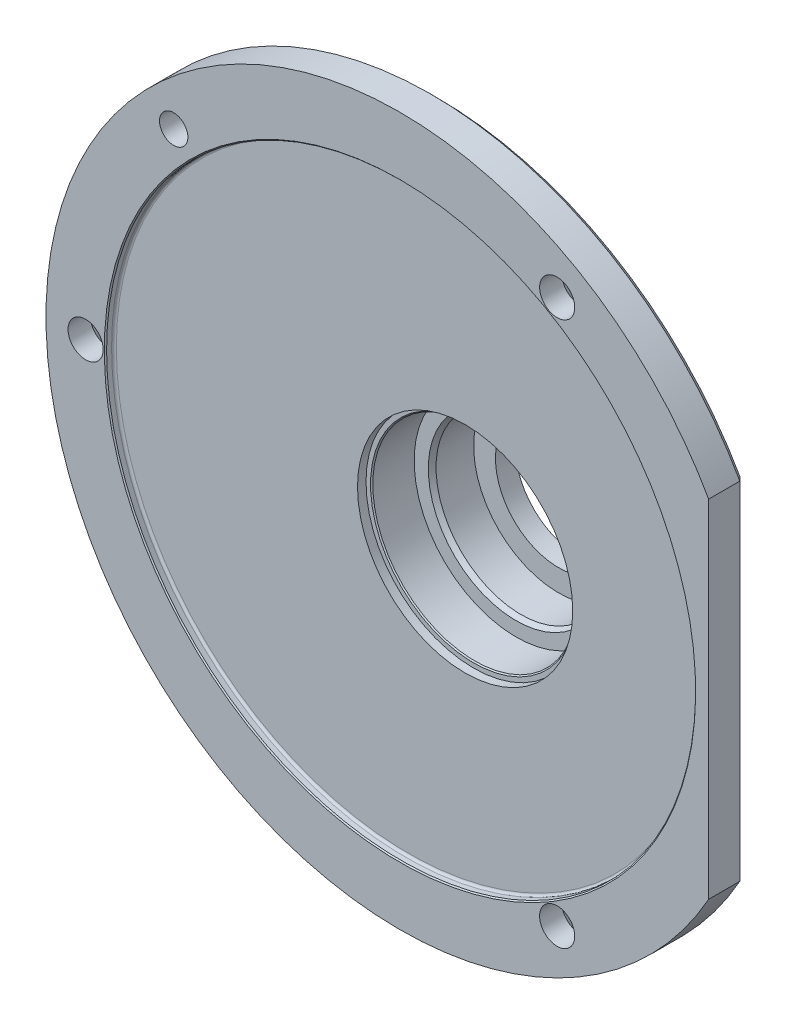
ISO-10303-21;
HEADER;
FILE_DESCRIPTION(('STEP AP214'),'2;1');
FILE_NAME('part.step','',(''),(''),'','','');
FILE_SCHEMA(('AUTOMOTIVE_DESIGN { 1 0 10303 214 1 1 1 1 }'));
ENDSEC;
DATA;
#1=APPLICATION_CONTEXT('core data for automotive mechanical design processes');
#2=APPLICATION_PROTOCOL_DEFINITION('international standard','automotive_design',2000,#1);
#3=PRODUCT_CONTEXT('',#1,'mechanical');
#4=PRODUCT('Part','Part','',(#3));
#5=PRODUCT_RELATED_PRODUCT_CATEGORY('part','',(#4));
#6=PRODUCT_DEFINITION_FORMATION('','',#4);
#7=PRODUCT_DEFINITION_CONTEXT('part definition',#1,'design');
#8=PRODUCT_DEFINITION('design','',#6,#7);
#9=PRODUCT_DEFINITION_SHAPE('','',#8);
#10=(LENGTH_UNIT() NAMED_UNIT(*) SI_UNIT(.MILLI.,.METRE.));
#11=(NAMED_UNIT(*) PLANE_ANGLE_UNIT() SI_UNIT($,.RADIAN.));
#12=(NAMED_UNIT(*) SI_UNIT($,.STERADIAN.) SOLID_ANGLE_UNIT());
#13=UNCERTAINTY_MEASURE_WITH_UNIT(LENGTH_MEASURE(1.E-05),#10,'distance_accuracy_value','');
#14=(GEOMETRIC_REPRESENTATION_CONTEXT(3) GLOBAL_UNCERTAINTY_ASSIGNED_CONTEXT((#13)) GLOBAL_UNIT_ASSIGNED_CONTEXT((#10,
#11,#12)) REPRESENTATION_CONTEXT('',''));
#15=CARTESIAN_POINT('',(0.,0.,0.));
#16=DIRECTION('',(0.,0.,1.));
#17=DIRECTION('',(1.,0.,0.));
#18=AXIS2_PLACEMENT_3D('',#15,#16,#17);
#19=CARTESIAN_POINT('',(10.,0.,0.));
#20=DIRECTION('',(0.,0.,1.));
#21=DIRECTION('',(1.,0.,0.));
#22=AXIS2_PLACEMENT_3D('',#19,#20,#21);
#23=CYLINDRICAL_SURFACE('',#22,11.1419208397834);
#24=CARTESIAN_POINT('',(10.,0.,0.));
#25=DIRECTION('',(0.,0.,1.));
#26=DIRECTION('',(1.,0.,0.));
#27=AXIS2_PLACEMENT_3D('',#24,#25,#26);
#28=CIRCLE('',#27,11.1419208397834);
#29=CARTESIAN_POINT('',(21.1419208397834,0.,0.));
#30=VERTEX_POINT('',#29);
#31=EDGE_CURVE('E501',#30,#30,#28,.T.);
#32=ORIENTED_EDGE('',*,*,#31,.F.);
#33=EDGE_LOOP('',(#32));
#34=FACE_BOUND('',#33,.T.);
#35=CARTESIAN_POINT('',(10.,0.,3.5));
#36=DIRECTION('',(0.,0.,1.));
#37=DIRECTION('',(1.,0.,0.));
#38=AXIS2_PLACEMENT_3D('',#35,#36,#37);
#39=CIRCLE('',#38,11.1419208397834);
#40=CARTESIAN_POINT('',(21.1419208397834,0.,3.5));
#41=VERTEX_POINT('',#40);
#42=EDGE_CURVE('E410',#41,#41,#39,.F.);
#43=ORIENTED_EDGE('',*,*,#42,.F.);
#44=EDGE_LOOP('',(#43));
#45=FACE_BOUND('',#44,.T.);
#46=ADVANCED_FACE('F37',(#34,#45),#23,.F.);
#47=CARTESIAN_POINT('',(0.,0.,0.));
#48=DIRECTION('',(0.,0.,1.));
#49=DIRECTION('',(1.,0.,0.));
#50=AXIS2_PLACEMENT_3D('',#47,#48,#49);
#51=PLANE('',#50);
#52=DIRECTION('',(-0.68225846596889,0.731111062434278,0.));
#53=VECTOR('',#52,1.);
#54=CARTESIAN_POINT('',(-2.,-12.,0.));
#55=LINE('',#54,#53);
#56=CARTESIAN_POINT('',(-2.,-12.,0.));
#57=VERTEX_POINT('',#56);
#58=CARTESIAN_POINT('',(-9.68275638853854,-3.76712570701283,0.));
#59=VERTEX_POINT('',#58);
#60=EDGE_CURVE('E378',#57,#59,#55,.T.);
#61=ORIENTED_EDGE('',*,*,#60,.F.);
#62=DIRECTION('',(0.0526911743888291,-0.998610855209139,0.));
#63=VECTOR('',#62,1.);
#64=CARTESIAN_POINT('',(-2.,-12.,0.));
#65=LINE('',#64,#63);
#66=CARTESIAN_POINT('',(-2.58433498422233,-0.925597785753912,0.));
#67=VERTEX_POINT('',#66);
#68=EDGE_CURVE('E52',#67,#57,#65,.T.);
#69=ORIENTED_EDGE('',*,*,#68,.F.);
#70=DIRECTION('',(0.333005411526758,0.942924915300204,0.));
#71=VECTOR('',#70,1.);
#72=CARTESIAN_POINT('',(-2.58433498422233,-0.925597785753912,0.));
#73=LINE('',#72,#71);
#74=CARTESIAN_POINT('',(-4.02325972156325,-5.,0.));
#75=VERTEX_POINT('',#74);
#76=EDGE_CURVE('E358',#75,#67,#73,.T.);
#77=ORIENTED_EDGE('',*,*,#76,.F.);
#78=CARTESIAN_POINT('',(12.6413661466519,-1.63990406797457,0.));
#79=DIRECTION('',(0.,0.,1.));
#80=DIRECTION('',(1.,0.,0.));
#81=AXIS2_PLACEMENT_3D('',#78,#79,#80);
#82=CIRCLE('',#81,17.);
#83=CARTESIAN_POINT('',(4.00000000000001,13.,0.));
#84=VERTEX_POINT('',#83);
#85=EDGE_CURVE('E361',#84,#75,#82,.T.);
#86=ORIENTED_EDGE('',*,*,#85,.F.);
#87=DIRECTION('',(0.904818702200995,0.42579703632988,0.));
#88=VECTOR('',#87,1.);
#89=CARTESIAN_POINT('',(-4.50000000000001,9.00000000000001,0.));
#90=LINE('',#89,#88);
#91=CARTESIAN_POINT('',(-4.50000000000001,9.00000000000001,0.));
#92=VERTEX_POINT('',#91);
#93=EDGE_CURVE('E389',#92,#84,#90,.T.);
#94=ORIENTED_EDGE('',*,*,#93,.F.);
#95=DIRECTION('',(-0.33871946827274,-0.940887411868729,0.));
#96=VECTOR('',#95,1.);
#97=CARTESIAN_POINT('',(-4.50000000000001,9.00000000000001,0.));
#98=LINE('',#97,#96);
#99=CARTESIAN_POINT('',(-0.999999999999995,18.7222222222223,0.));
#100=VERTEX_POINT('',#99);
#101=EDGE_CURVE('E386',#100,#92,#98,.T.);
#102=ORIENTED_EDGE('',*,*,#101,.F.);
#103=CARTESIAN_POINT('',(7.95217210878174,4.27028067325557,0.));
#104=DIRECTION('',(0.,0.,-1.));
#105=DIRECTION('',(1.,0.,0.));
#106=AXIS2_PLACEMENT_3D('',#103,#104,#105);
#107=CIRCLE('',#106,17.);
#108=CARTESIAN_POINT('',(-5.95975139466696,-5.50000000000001,0.));
#109=VERTEX_POINT('',#108);
#110=EDGE_CURVE('E383',#109,#100,#107,.T.);
#111=ORIENTED_EDGE('',*,*,#110,.F.);
#112=DIRECTION('',(0.906605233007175,-0.421979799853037,0.));
#113=VECTOR('',#112,1.);
#114=CARTESIAN_POINT('',(-9.68275638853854,-3.76712570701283,0.));
#115=LINE('',#114,#113);
#116=EDGE_CURVE('E380',#59,#109,#115,.T.);
#117=ORIENTED_EDGE('',*,*,#116,.F.);
#118=EDGE_LOOP('',(#61,#69,#77,#86,#94,#102,#111,#117));
#119=FACE_BOUND('',#118,.T.);
#120=DIRECTION('',(0.,-1.,0.));
#121=VECTOR('',#120,1.);
#122=CARTESIAN_POINT('',(-13.5702260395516,41.4946702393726,0.));
#123=LINE('',#122,#121);
#124=CARTESIAN_POINT('',(-13.5702260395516,4.96903626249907,0.));
#125=VERTEX_POINT('',#124);
#126=CARTESIAN_POINT('',(-13.5702260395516,-4.96903626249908,0.));
#127=VERTEX_POINT('',#126);
#128=EDGE_CURVE('E457',#125,#127,#123,.T.);
#129=ORIENTED_EDGE('',*,*,#128,.F.);
#130=CARTESIAN_POINT('',(-18.6356421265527,10.5,0.));
#131=DIRECTION('',(0.,0.,1.));
#132=DIRECTION('',(1.,0.,0.));
#133=AXIS2_PLACEMENT_3D('',#130,#131,#132);
#134=CIRCLE('',#133,7.5);
#135=CARTESIAN_POINT('',(-11.5940907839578,7.91803278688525,0.));
#136=VERTEX_POINT('',#135);
#137=EDGE_CURVE('E711',#125,#136,#134,.T.);
#138=ORIENTED_EDGE('',*,*,#137,.T.);
#139=CARTESIAN_POINT('',(10.,0.,0.));
#140=DIRECTION('',(0.,0.,1.));
#141=DIRECTION('',(1.,0.,0.));
#142=AXIS2_PLACEMENT_3D('',#139,#140,#141);
#143=CIRCLE('',#142,23.);
#144=CARTESIAN_POINT('',(10.0530774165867,22.9999387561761,0.));
#145=VERTEX_POINT('',#144);
#146=EDGE_CURVE('E707',#136,#145,#143,.F.);
#147=ORIENTED_EDGE('',*,*,#146,.T.);
#148=CARTESIAN_POINT('',(10.0703852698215,30.4999187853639,0.));
#149=DIRECTION('',(0.,0.,1.));
#150=DIRECTION('',(1.,0.,0.));
#151=AXIS2_PLACEMENT_3D('',#148,#149,#150);
#152=CIRCLE('',#151,7.5);
#153=CARTESIAN_POINT('',(13.5040505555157,23.8320898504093,0.));
#154=VERTEX_POINT('',#153);
#155=EDGE_CURVE('E709',#145,#154,#152,.T.);
#156=ORIENTED_EDGE('',*,*,#155,.T.);
#157=DIRECTION('',(0.93807655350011,-0.346428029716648,0.));
#158=VECTOR('',#157,1.);
#159=CARTESIAN_POINT('',(-9.2383680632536,32.2307767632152,0.));
#160=LINE('',#159,#158);
#161=CARTESIAN_POINT('',(22.8267233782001,20.389262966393,0.));
#162=VERTEX_POINT('',#161);
#163=EDGE_CURVE('E431',#154,#162,#160,.T.);
#164=ORIENTED_EDGE('',*,*,#163,.T.);
#165=CARTESIAN_POINT('',(29.7699928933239,23.2249301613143,0.));
#166=DIRECTION('',(0.,0.,1.));
#167=DIRECTION('',(1.,0.,0.));
#168=AXIS2_PLACEMENT_3D('',#165,#166,#167);
#169=CIRCLE('',#168,7.5);
#170=CARTESIAN_POINT('',(24.9085192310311,17.5138817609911,0.));
#171=VERTEX_POINT('',#170);
#172=EDGE_CURVE('E704',#162,#171,#169,.T.);
#173=ORIENTED_EDGE('',*,*,#172,.T.);
#174=CARTESIAN_POINT('',(10.,0.,0.));
#175=DIRECTION('',(0.,0.,1.));
#176=DIRECTION('',(1.,0.,0.));
#177=AXIS2_PLACEMENT_3D('',#174,#175,#176);
#178=CIRCLE('',#177,23.);
#179=CARTESIAN_POINT('',(24.9085192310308,-17.5138817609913,0.));
#180=VERTEX_POINT('',#179);
#181=EDGE_CURVE('E700',#171,#180,#178,.F.);
#182=ORIENTED_EDGE('',*,*,#181,.T.);
#183=CARTESIAN_POINT('',(29.7699928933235,-23.2249301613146,0.));
#184=DIRECTION('',(0.,0.,1.));
#185=DIRECTION('',(1.,0.,0.));
#186=AXIS2_PLACEMENT_3D('',#183,#184,#185);
#187=CIRCLE('',#186,7.5);
#188=CARTESIAN_POINT('',(22.8267233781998,-20.3892629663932,0.));
#189=VERTEX_POINT('',#188);
#190=EDGE_CURVE('E702',#180,#189,#187,.T.);
#191=ORIENTED_EDGE('',*,*,#190,.T.);
#192=DIRECTION('',(-0.938076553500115,-0.346428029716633,0.));
#193=VECTOR('',#192,1.);
#194=CARTESIAN_POINT('',(45.5691419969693,-11.9905760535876,0.));
#195=LINE('',#194,#193);
#196=CARTESIAN_POINT('',(13.5040505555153,-23.8320898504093,0.));
#197=VERTEX_POINT('',#196);
#198=EDGE_CURVE('E445',#189,#197,#195,.T.);
#199=ORIENTED_EDGE('',*,*,#198,.T.);
#200=CARTESIAN_POINT('',(10.0703852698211,-30.4999187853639,0.));
#201=DIRECTION('',(0.,0.,1.));
#202=DIRECTION('',(1.,0.,0.));
#203=AXIS2_PLACEMENT_3D('',#200,#201,#202);
#204=CIRCLE('',#203,7.5);
#205=CARTESIAN_POINT('',(10.0530774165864,-22.9999387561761,0.));
#206=VERTEX_POINT('',#205);
#207=EDGE_CURVE('E697',#197,#206,#204,.T.);
#208=ORIENTED_EDGE('',*,*,#207,.T.);
#209=CARTESIAN_POINT('',(10.,0.,0.));
#210=DIRECTION('',(0.,0.,1.));
#211=DIRECTION('',(1.,0.,0.));
#212=AXIS2_PLACEMENT_3D('',#209,#210,#211);
#213=CIRCLE('',#212,23.);
#214=CARTESIAN_POINT('',(-11.5940907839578,-7.91803278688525,0.));
#215=VERTEX_POINT('',#214);
#216=EDGE_CURVE('E658',#206,#215,#213,.F.);
#217=ORIENTED_EDGE('',*,*,#216,.T.);
#218=CARTESIAN_POINT('',(-18.6356421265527,-10.5,0.));
#219=DIRECTION('',(0.,0.,1.));
#220=DIRECTION('',(1.,0.,0.));
#221=AXIS2_PLACEMENT_3D('',#218,#219,#220);
#222=CIRCLE('',#221,7.5);
#223=EDGE_CURVE('E695',#215,#127,#222,.T.);
#224=ORIENTED_EDGE('',*,*,#223,.T.);
#225=EDGE_LOOP('',(#129,#138,#147,#156,#164,#173,#182,#191,#199,#208,#217,#224));
#226=FACE_BOUND('',#225,.T.);
#227=ORIENTED_EDGE('',*,*,#31,.T.);
#228=EDGE_LOOP('',(#227));
#229=FACE_BOUND('',#228,.T.);
#230=ADVANCED_FACE('F863',(#119,#226,#229),#51,.F.);
#231=CARTESIAN_POINT('',(0.,0.,15.));
#232=DIRECTION('',(0.,0.,-1.));
#233=DIRECTION('',(-1.,0.,0.));
#234=AXIS2_PLACEMENT_3D('',#231,#232,#233);
#235=PLANE('',#234);
#236=DIRECTION('',(-0.346428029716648,-0.93807655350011,0.));
#237=VECTOR('',#236,1.);
#238=CARTESIAN_POINT('',(18.1806417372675,-6.71404041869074,15.));
#239=LINE('',#238,#237);
#240=CARTESIAN_POINT('',(29.3009546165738,23.3981441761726,15.));
#241=VERTEX_POINT('',#240);
#242=CARTESIAN_POINT('',(34.1306107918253,36.4761483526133,15.));
#243=VERTEX_POINT('',#242);
#244=EDGE_CURVE('E608',#241,#243,#239,.F.);
#245=ORIENTED_EDGE('',*,*,#244,.T.);
#246=DIRECTION('',(-0.93807655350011,0.346428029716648,0.));
#247=VECTOR('',#246,1.);
#248=CARTESIAN_POINT('',(15.9499690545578,43.1901887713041,15.));
#249=LINE('',#248,#247);
#250=CARTESIAN_POINT('',(29.4402280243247,38.2082885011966,15.));
#251=VERTEX_POINT('',#250);
#252=EDGE_CURVE('E611',#243,#251,#249,.T.);
#253=ORIENTED_EDGE('',*,*,#252,.T.);
#254=CARTESIAN_POINT('',(27.7500000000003,48.0644099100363,15.));
#255=DIRECTION('',(0.,0.,1.));
#256=DIRECTION('',(-1.,0.,0.));
#257=AXIS2_PLACEMENT_3D('',#254,#255,#256);
#258=CIRCLE('',#257,10.);
#259=CARTESIAN_POINT('',(20.0594624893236,41.6725687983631,15.));
#260=VERTEX_POINT('',#259);
#261=EDGE_CURVE('E470',#260,#251,#258,.T.);
#262=ORIENTED_EDGE('',*,*,#261,.F.);
#263=DIRECTION('',(-0.93807655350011,0.346428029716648,0.));
#264=VECTOR('',#263,1.);
#265=CARTESIAN_POINT('',(15.9499690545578,43.1901887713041,15.));
#266=LINE('',#265,#264);
#267=CARTESIAN_POINT('',(15.3690797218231,43.4047089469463,15.));
#268=VERTEX_POINT('',#267);
#269=EDGE_CURVE('E578',#260,#268,#266,.T.);
#270=ORIENTED_EDGE('',*,*,#269,.T.);
#271=DIRECTION('',(0.346428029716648,0.93807655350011,0.));
#272=VECTOR('',#271,1.);
#273=CARTESIAN_POINT('',(-0.58088933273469,0.214520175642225,15.));
#274=LINE('',#273,#272);
#275=CARTESIAN_POINT('',(10.5394235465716,30.3267047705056,15.));
#276=VERTEX_POINT('',#275);
#277=EDGE_CURVE('E576',#268,#276,#274,.F.);
#278=ORIENTED_EDGE('',*,*,#277,.T.);
#279=CARTESIAN_POINT('',(10.0703852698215,30.4999187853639,15.));
#280=DIRECTION('',(0.,0.,-1.));
#281=DIRECTION('',(-1.,0.,0.));
#282=AXIS2_PLACEMENT_3D('',#279,#280,#281);
#283=CIRCLE('',#282,0.5);
#284=CARTESIAN_POINT('',(10.0692314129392,29.9999201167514,15.));
#285=VERTEX_POINT('',#284);
#286=EDGE_CURVE('E574',#276,#285,#283,.T.);
#287=ORIENTED_EDGE('',*,*,#286,.T.);
#288=CARTESIAN_POINT('',(10.,0.,15.));
#289=DIRECTION('',(0.,0.,-1.));
#290=DIRECTION('',(-1.,0.,0.));
#291=AXIS2_PLACEMENT_3D('',#288,#289,#290);
#292=CIRCLE('',#291,30.);
#293=CARTESIAN_POINT('',(-18.1662053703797,10.327868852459,15.));
#294=VERTEX_POINT('',#293);
#295=EDGE_CURVE('E572',#285,#294,#292,.F.);
#296=ORIENTED_EDGE('',*,*,#295,.T.);
#297=CARTESIAN_POINT('',(-18.6356421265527,10.5,15.));
#298=DIRECTION('',(0.,0.,-1.));
#299=DIRECTION('',(-1.,0.,0.));
#300=AXIS2_PLACEMENT_3D('',#297,#298,#299);
#301=CIRCLE('',#300,0.5);
#302=CARTESIAN_POINT('',(-18.6356421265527,10.,15.));
#303=VERTEX_POINT('',#302);
#304=EDGE_CURVE('E570',#294,#303,#301,.T.);
#305=ORIENTED_EDGE('',*,*,#304,.T.);
#306=DIRECTION('',(1.,0.,0.));
#307=VECTOR('',#306,1.);
#308=CARTESIAN_POINT('',(0.,10.,15.));
#309=LINE('',#308,#307);
#310=CARTESIAN_POINT('',(-46.8397459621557,10.,15.));
#311=VERTEX_POINT('',#310);
#312=EDGE_CURVE('E567',#303,#311,#309,.F.);
#313=ORIENTED_EDGE('',*,*,#312,.T.);
#314=DIRECTION('',(0.,-1.,0.));
#315=VECTOR('',#314,1.);
#316=CARTESIAN_POINT('',(-46.8397459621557,0.,15.));
#317=LINE('',#316,#315);
#318=CARTESIAN_POINT('',(-46.8397459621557,5.,15.));
#319=VERTEX_POINT('',#318);
#320=EDGE_CURVE('E565',#311,#319,#317,.T.);
#321=ORIENTED_EDGE('',*,*,#320,.T.);
#322=CARTESIAN_POINT('',(-55.5000000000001,0.,15.));
#323=DIRECTION('',(0.,0.,1.));
#324=DIRECTION('',(-1.,0.,0.));
#325=AXIS2_PLACEMENT_3D('',#322,#323,#324);
#326=CIRCLE('',#325,10.);
#327=CARTESIAN_POINT('',(-46.8397459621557,-5.00000000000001,15.));
#328=VERTEX_POINT('',#327);
#329=EDGE_CURVE('E467',#328,#319,#326,.T.);
#330=ORIENTED_EDGE('',*,*,#329,.F.);
#331=DIRECTION('',(0.,-1.,0.));
#332=VECTOR('',#331,1.);
#333=CARTESIAN_POINT('',(-46.8397459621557,0.,15.));
#334=LINE('',#333,#332);
#335=CARTESIAN_POINT('',(-46.8397459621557,-10.,15.));
#336=VERTEX_POINT('',#335);
#337=EDGE_CURVE('E594',#328,#336,#334,.T.);
#338=ORIENTED_EDGE('',*,*,#337,.T.);
#339=DIRECTION('',(-1.,0.,0.));
#340=VECTOR('',#339,1.);
#341=CARTESIAN_POINT('',(0.,-10.,15.));
#342=LINE('',#341,#340);
#343=CARTESIAN_POINT('',(-18.6356421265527,-10.,15.));
#344=VERTEX_POINT('',#343);
#345=EDGE_CURVE('E592',#336,#344,#342,.F.);
#346=ORIENTED_EDGE('',*,*,#345,.T.);
#347=CARTESIAN_POINT('',(-18.6356421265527,-10.5,15.));
#348=DIRECTION('',(0.,0.,-1.));
#349=DIRECTION('',(-1.,0.,0.));
#350=AXIS2_PLACEMENT_3D('',#347,#348,#349);
#351=CIRCLE('',#350,0.5);
#352=CARTESIAN_POINT('',(-18.1662053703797,-10.327868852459,15.));
#353=VERTEX_POINT('',#352);
#354=EDGE_CURVE('E590',#344,#353,#351,.T.);
#355=ORIENTED_EDGE('',*,*,#354,.T.);
#356=CARTESIAN_POINT('',(10.,0.,15.));
#357=DIRECTION('',(0.,0.,-1.));
#358=DIRECTION('',(-1.,0.,0.));
#359=AXIS2_PLACEMENT_3D('',#356,#357,#358);
#360=CIRCLE('',#359,30.);
#361=CARTESIAN_POINT('',(10.0692314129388,-29.9999201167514,15.));
#362=VERTEX_POINT('',#361);
#363=EDGE_CURVE('E588',#353,#362,#360,.F.);
#364=ORIENTED_EDGE('',*,*,#363,.T.);
#365=CARTESIAN_POINT('',(10.0703852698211,-30.4999187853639,15.));
#366=DIRECTION('',(0.,0.,-1.));
#367=DIRECTION('',(-1.,0.,0.));
#368=AXIS2_PLACEMENT_3D('',#365,#366,#367);
#369=CIRCLE('',#368,0.5);
#370=CARTESIAN_POINT('',(10.5394235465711,-30.3267047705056,15.));
#371=VERTEX_POINT('',#370);
#372=EDGE_CURVE('E586',#362,#371,#369,.T.);
#373=ORIENTED_EDGE('',*,*,#372,.T.);
#374=DIRECTION('',(-0.346428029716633,0.938076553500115,0.));
#375=VECTOR('',#374,1.);
#376=CARTESIAN_POINT('',(-0.580889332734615,-0.214520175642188,15.));
#377=LINE('',#376,#375);
#378=CARTESIAN_POINT('',(15.3690797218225,-43.4047089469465,15.));
#379=VERTEX_POINT('',#378);
#380=EDGE_CURVE('E583',#371,#379,#377,.F.);
#381=ORIENTED_EDGE('',*,*,#380,.T.);
#382=DIRECTION('',(0.938076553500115,0.346428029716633,0.));
#383=VECTOR('',#382,1.);
#384=CARTESIAN_POINT('',(15.9499690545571,-43.1901887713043,15.));
#385=LINE('',#384,#383);
#386=CARTESIAN_POINT('',(20.0594624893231,-41.6725687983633,15.));
#387=VERTEX_POINT('',#386);
#388=EDGE_CURVE('E581',#379,#387,#385,.T.);
#389=ORIENTED_EDGE('',*,*,#388,.T.);
#390=CARTESIAN_POINT('',(27.7499999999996,-48.0644099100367,15.));
#391=DIRECTION('',(0.,0.,1.));
#392=DIRECTION('',(-1.,0.,0.));
#393=AXIS2_PLACEMENT_3D('',#390,#391,#392);
#394=CIRCLE('',#393,10.);
#395=CARTESIAN_POINT('',(29.4402280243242,-38.208288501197,15.));
#396=VERTEX_POINT('',#395);
#397=EDGE_CURVE('E464',#396,#387,#394,.T.);
#398=ORIENTED_EDGE('',*,*,#397,.F.);
#399=DIRECTION('',(0.938076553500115,0.346428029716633,0.));
#400=VECTOR('',#399,1.);
#401=CARTESIAN_POINT('',(15.9499690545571,-43.1901887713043,15.));
#402=LINE('',#401,#400);
#403=CARTESIAN_POINT('',(34.1306107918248,-36.4761483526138,15.));
#404=VERTEX_POINT('',#403);
#405=EDGE_CURVE('E603',#396,#404,#402,.T.);
#406=ORIENTED_EDGE('',*,*,#405,.T.);
#407=DIRECTION('',(0.346428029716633,-0.938076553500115,0.));
#408=VECTOR('',#407,1.);
#409=CARTESIAN_POINT('',(18.1806417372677,6.71404041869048,15.));
#410=LINE('',#409,#408);
#411=CARTESIAN_POINT('',(29.3009546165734,-23.3981441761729,15.));
#412=VERTEX_POINT('',#411);
#413=EDGE_CURVE('E601',#404,#412,#410,.F.);
#414=ORIENTED_EDGE('',*,*,#413,.T.);
#415=CARTESIAN_POINT('',(29.7699928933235,-23.2249301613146,15.));
#416=DIRECTION('',(0.,0.,-1.));
#417=DIRECTION('',(-1.,0.,0.));
#418=AXIS2_PLACEMENT_3D('',#415,#416,#417);
#419=CIRCLE('',#418,0.5);
#420=CARTESIAN_POINT('',(29.4458946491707,-22.8441936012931,15.));
#421=VERTEX_POINT('',#420);
#422=EDGE_CURVE('E599',#412,#421,#419,.T.);
#423=ORIENTED_EDGE('',*,*,#422,.T.);
#424=CARTESIAN_POINT('',(10.,0.,15.));
#425=DIRECTION('',(0.,0.,-1.));
#426=DIRECTION('',(-1.,0.,0.));
#427=AXIS2_PLACEMENT_3D('',#424,#425,#426);
#428=CIRCLE('',#427,30.);
#429=CARTESIAN_POINT('',(29.445894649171,22.8441936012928,15.));
#430=VERTEX_POINT('',#429);
#431=EDGE_CURVE('E597',#421,#430,#428,.F.);
#432=ORIENTED_EDGE('',*,*,#431,.T.);
#433=CARTESIAN_POINT('',(29.7699928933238,23.2249301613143,15.));
#434=DIRECTION('',(0.,0.,-1.));
#435=DIRECTION('',(-1.,0.,0.));
#436=AXIS2_PLACEMENT_3D('',#433,#434,#435);
#437=CIRCLE('',#436,0.5);
#438=EDGE_CURVE('E606',#430,#241,#437,.T.);
#439=ORIENTED_EDGE('',*,*,#438,.T.);
#440=EDGE_LOOP('',(#245,#253,#262,#270,#278,#287,#296,#305,#313,#321,#330,#338,#346,#355,#364,
#373,#381,#389,#398,#406,#414,#423,#432,#439));
#441=FACE_BOUND('',#440,.T.);
#442=CARTESIAN_POINT('',(0.,0.,15.));
#443=DIRECTION('',(0.,0.,-1.));
#444=DIRECTION('',(-1.,0.,0.));
#445=AXIS2_PLACEMENT_3D('',#442,#443,#444);
#446=CIRCLE('',#445,61.5);
#447=CARTESIAN_POINT('',(53.5000000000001,-30.3315017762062,15.));
#448=VERTEX_POINT('',#447);
#449=CARTESIAN_POINT('',(53.5000000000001,30.3315017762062,15.));
#450=VERTEX_POINT('',#449);
#451=EDGE_CURVE('E722',#448,#450,#446,.T.);
#452=ORIENTED_EDGE('',*,*,#451,.T.);
#453=DIRECTION('',(0.,-1.,0.));
#454=VECTOR('',#453,1.);
#455=CARTESIAN_POINT('',(53.5000000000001,-28.49561369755,15.));
#456=LINE('',#455,#454);
#457=EDGE_CURVE('E1764',#450,#448,#456,.T.);
#458=ORIENTED_EDGE('',*,*,#457,.T.);
#459=EDGE_LOOP('',(#452,#458));
#460=FACE_BOUND('',#459,.T.);
#461=CARTESIAN_POINT('',(-55.5000000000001,0.,15.));
#462=DIRECTION('',(0.,0.,-1.));
#463=DIRECTION('',(-1.,0.,0.));
#464=AXIS2_PLACEMENT_3D('',#461,#462,#463);
#465=CIRCLE('',#464,5.64999999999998);
#466=CARTESIAN_POINT('',(-61.1500000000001,0.,15.));
#467=VERTEX_POINT('',#466);
#468=EDGE_CURVE('E512',#467,#467,#465,.F.);
#469=ORIENTED_EDGE('',*,*,#468,.T.);
#470=EDGE_LOOP('',(#469));
#471=FACE_BOUND('',#470,.T.);
#472=CARTESIAN_POINT('',(27.7500000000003,48.0644099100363,15.));
#473=DIRECTION('',(0.,0.,-1.));
#474=DIRECTION('',(-1.,0.,0.));
#475=AXIS2_PLACEMENT_3D('',#472,#473,#474);
#476=CIRCLE('',#475,5.65);
#477=CARTESIAN_POINT('',(22.1000000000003,48.0644099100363,15.));
#478=VERTEX_POINT('',#477);
#479=EDGE_CURVE('E518',#478,#478,#476,.F.);
#480=ORIENTED_EDGE('',*,*,#479,.T.);
#481=EDGE_LOOP('',(#480));
#482=FACE_BOUND('',#481,.T.);
#483=CARTESIAN_POINT('',(27.7499999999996,-48.0644099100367,15.));
#484=DIRECTION('',(0.,0.,-1.));
#485=DIRECTION('',(-1.,0.,0.));
#486=AXIS2_PLACEMENT_3D('',#483,#484,#485);
#487=CIRCLE('',#486,5.65000000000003);
#488=CARTESIAN_POINT('',(22.0999999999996,-48.0644099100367,15.));
#489=VERTEX_POINT('',#488);
#490=EDGE_CURVE('E524',#489,#489,#487,.F.);
#491=ORIENTED_EDGE('',*,*,#490,.T.);
#492=EDGE_LOOP('',(#491));
#493=FACE_BOUND('',#492,.T.);
#494=CARTESIAN_POINT('',(-39.9515331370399,39.9515331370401,15.));
#495=DIRECTION('',(0.,0.,-1.));
#496=DIRECTION('',(-1.,0.,0.));
#497=AXIS2_PLACEMENT_3D('',#494,#495,#496);
#498=CIRCLE('',#497,2.5);
#499=CARTESIAN_POINT('',(-42.4515331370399,39.9515331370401,15.));
#500=VERTEX_POINT('',#499);
#501=EDGE_CURVE('E476',#500,#500,#498,.F.);
#502=ORIENTED_EDGE('',*,*,#501,.T.);
#503=EDGE_LOOP('',(#502));
#504=FACE_BOUND('',#503,.T.);
#505=ADVANCED_FACE('F869',(#441,#460,#471,#482,#493,#504),#235,.T.);
#506=CARTESIAN_POINT('',(10.,0.,15.));
#507=DIRECTION('',(0.,0.,-1.));
#508=DIRECTION('',(-1.,0.,0.));
#509=AXIS2_PLACEMENT_3D('',#506,#507,#508);
#510=CYLINDRICAL_SURFACE('',#509,25.);
#511=DIRECTION('',(0.,0.,-1.));
#512=VECTOR('',#511,1.);
#513=CARTESIAN_POINT('',(-13.4718378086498,-8.60655737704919,15.));
#514=LINE('',#513,#512);
#515=CARTESIAN_POINT('',(-13.4718378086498,-8.60655737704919,9.99999999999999));
#516=VERTEX_POINT('',#515);
#517=CARTESIAN_POINT('',(-13.4718378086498,-8.60655737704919,2.));
#518=VERTEX_POINT('',#517);
#519=EDGE_CURVE('E527',#516,#518,#514,.T.);
#520=ORIENTED_EDGE('',*,*,#519,.T.);
#521=CARTESIAN_POINT('',(10.,0.,2.));
#522=DIRECTION('',(0.,0.,1.));
#523=DIRECTION('',(1.,0.,0.));
#524=AXIS2_PLACEMENT_3D('',#521,#522,#523);
#525=CIRCLE('',#524,25.);
#526=CARTESIAN_POINT('',(10.0576928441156,-24.9999334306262,2.));
#527=VERTEX_POINT('',#526);
#528=EDGE_CURVE('E720',#518,#527,#525,.T.);
#529=ORIENTED_EDGE('',*,*,#528,.T.);
#530=DIRECTION('',(0.,0.,-1.));
#531=VECTOR('',#530,1.);
#532=CARTESIAN_POINT('',(10.0576928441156,-24.9999334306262,15.));
#533=LINE('',#532,#531);
#534=CARTESIAN_POINT('',(10.0576928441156,-24.9999334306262,9.99999999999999));
#535=VERTEX_POINT('',#534);
#536=EDGE_CURVE('E532',#527,#535,#533,.F.);
#537=ORIENTED_EDGE('',*,*,#536,.T.);
#538=CARTESIAN_POINT('',(10.,0.,9.99999999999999));
#539=DIRECTION('',(0.,0.,-1.));
#540=DIRECTION('',(-1.,0.,0.));
#541=AXIS2_PLACEMENT_3D('',#538,#539,#540);
#542=CIRCLE('',#541,25.);
#543=EDGE_CURVE('E625',#535,#516,#542,.T.);
#544=ORIENTED_EDGE('',*,*,#543,.T.);
#545=EDGE_LOOP('',(#520,#529,#537,#544));
#546=FACE_BOUND('',#545,.T.);
#547=ADVANCED_FACE('F1118',(#546),#510,.T.);
#548=DIRECTION('',(0.,0.,-1.));
#549=VECTOR('',#548,1.);
#550=CARTESIAN_POINT('',(26.2049122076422,-19.0368280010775,15.));
#551=LINE('',#550,#549);
#552=CARTESIAN_POINT('',(26.2049122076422,-19.0368280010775,10.));
#553=VERTEX_POINT('',#552);
#554=CARTESIAN_POINT('',(26.2049122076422,-19.0368280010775,2.));
#555=VERTEX_POINT('',#554);
#556=EDGE_CURVE('E551',#553,#555,#551,.T.);
#557=ORIENTED_EDGE('',*,*,#556,.T.);
#558=CARTESIAN_POINT('',(10.,0.,2.));
#559=DIRECTION('',(0.,0.,1.));
#560=DIRECTION('',(1.,0.,0.));
#561=AXIS2_PLACEMENT_3D('',#558,#559,#560);
#562=CIRCLE('',#561,25.);
#563=CARTESIAN_POINT('',(26.2049122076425,19.0368280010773,2.));
#564=VERTEX_POINT('',#563);
#565=EDGE_CURVE('E717',#555,#564,#562,.T.);
#566=ORIENTED_EDGE('',*,*,#565,.T.);
#567=DIRECTION('',(0.,0.,-1.));
#568=VECTOR('',#567,1.);
#569=CARTESIAN_POINT('',(26.2049122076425,19.0368280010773,15.));
#570=LINE('',#569,#568);
#571=CARTESIAN_POINT('',(26.2049122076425,19.0368280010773,10.));
#572=VERTEX_POINT('',#571);
#573=EDGE_CURVE('E554',#564,#572,#570,.F.);
#574=ORIENTED_EDGE('',*,*,#573,.T.);
#575=CARTESIAN_POINT('',(10.,0.,9.99999999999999));
#576=DIRECTION('',(0.,0.,-1.));
#577=DIRECTION('',(-1.,0.,0.));
#578=AXIS2_PLACEMENT_3D('',#575,#576,#577);
#579=CIRCLE('',#578,25.);
#580=EDGE_CURVE('E640',#572,#553,#579,.T.);
#581=ORIENTED_EDGE('',*,*,#580,.T.);
#582=EDGE_LOOP('',(#557,#566,#574,#581));
#583=FACE_BOUND('',#582,.T.);
#584=ADVANCED_FACE('F1151',(#583),#510,.T.);
#585=DIRECTION('',(0.,0.,-1.));
#586=VECTOR('',#585,1.);
#587=CARTESIAN_POINT('',(10.057692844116,24.9999334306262,15.));
#588=LINE('',#587,#586);
#589=CARTESIAN_POINT('',(10.057692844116,24.9999334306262,10.));
#590=VERTEX_POINT('',#589);
#591=CARTESIAN_POINT('',(10.057692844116,24.9999334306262,2.));
#592=VERTEX_POINT('',#591);
#593=EDGE_CURVE('E540',#590,#592,#588,.T.);
#594=ORIENTED_EDGE('',*,*,#593,.T.);
#595=CARTESIAN_POINT('',(10.,0.,2.));
#596=DIRECTION('',(0.,0.,1.));
#597=DIRECTION('',(1.,0.,0.));
#598=AXIS2_PLACEMENT_3D('',#595,#596,#597);
#599=CIRCLE('',#598,25.);
#600=CARTESIAN_POINT('',(-13.4718378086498,8.60655737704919,2.));
#601=VERTEX_POINT('',#600);
#602=EDGE_CURVE('E715',#592,#601,#599,.T.);
#603=ORIENTED_EDGE('',*,*,#602,.T.);
#604=DIRECTION('',(0.,0.,-1.));
#605=VECTOR('',#604,1.);
#606=CARTESIAN_POINT('',(-13.4718378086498,8.60655737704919,15.));
#607=LINE('',#606,#605);
#608=CARTESIAN_POINT('',(-13.4718378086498,8.60655737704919,9.99999999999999));
#609=VERTEX_POINT('',#608);
#610=EDGE_CURVE('E543',#601,#609,#607,.F.);
#611=ORIENTED_EDGE('',*,*,#610,.T.);
#612=CARTESIAN_POINT('',(10.,0.,9.99999999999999));
#613=DIRECTION('',(0.,0.,-1.));
#614=DIRECTION('',(-1.,0.,0.));
#615=AXIS2_PLACEMENT_3D('',#612,#613,#614);
#616=CIRCLE('',#615,25.);
#617=EDGE_CURVE('E635',#609,#590,#616,.T.);
#618=ORIENTED_EDGE('',*,*,#617,.T.);
#619=EDGE_LOOP('',(#594,#603,#611,#618));
#620=FACE_BOUND('',#619,.T.);
#621=ADVANCED_FACE('F1149',(#620),#510,.T.);
#622=CARTESIAN_POINT('',(-62.5000000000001,62.5000000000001,21.5));
#623=DIRECTION('',(0.,0.,-1.));
#624=DIRECTION('',(0.,1.,0.));
#625=AXIS2_PLACEMENT_3D('',#622,#623,#624);
#626=PLANE('',#625);
#627=CARTESIAN_POINT('',(0.,0.,21.5));
#628=DIRECTION('',(0.,0.,-1.));
#629=DIRECTION('',(0.,1.,0.));
#630=AXIS2_PLACEMENT_3D('',#627,#628,#629);
#631=CIRCLE('',#630,52.2);
#632=CARTESIAN_POINT('',(0.,52.2000000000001,21.5));
#633=VERTEX_POINT('',#632);
#634=EDGE_CURVE('E820',#633,#633,#631,.T.);
#635=ORIENTED_EDGE('',*,*,#634,.T.);
#636=EDGE_LOOP('',(#635));
#637=FACE_BOUND('',#636,.T.);
#638=CARTESIAN_POINT('',(0.,0.,21.5));
#639=DIRECTION('',(0.,0.,-1.));
#640=DIRECTION('',(0.,1.,0.));
#641=AXIS2_PLACEMENT_3D('',#638,#639,#640);
#642=CIRCLE('',#641,62.5);
#643=CARTESIAN_POINT('',(54.5000000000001,-30.5941170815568,21.5));
#644=VERTEX_POINT('',#643);
#645=CARTESIAN_POINT('',(54.5000000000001,30.5941170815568,21.5));
#646=VERTEX_POINT('',#645);
#647=EDGE_CURVE('E489',#644,#646,#642,.T.);
#648=ORIENTED_EDGE('',*,*,#647,.F.);
#649=DIRECTION('',(0.,1.,0.));
#650=VECTOR('',#649,1.);
#651=CARTESIAN_POINT('',(54.5000000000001,62.5000000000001,21.5));
#652=LINE('',#651,#650);
#653=EDGE_CURVE('E479',#644,#646,#652,.T.);
#654=ORIENTED_EDGE('',*,*,#653,.T.);
#655=EDGE_LOOP('',(#648,#654));
#656=FACE_BOUND('',#655,.T.);
#657=CARTESIAN_POINT('',(-55.5000000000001,0.,21.5));
#658=DIRECTION('',(0.,0.,-1.));
#659=DIRECTION('',(0.,1.,0.));
#660=AXIS2_PLACEMENT_3D('',#657,#658,#659);
#661=CIRCLE('',#660,3.1);
#662=CARTESIAN_POINT('',(-55.5000000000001,3.1,21.5));
#663=VERTEX_POINT('',#662);
#664=EDGE_CURVE('E486',#663,#663,#661,.F.);
#665=ORIENTED_EDGE('',*,*,#664,.F.);
#666=EDGE_LOOP('',(#665));
#667=FACE_BOUND('',#666,.T.);
#668=CARTESIAN_POINT('',(27.7499999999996,-48.0644099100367,21.5));
#669=DIRECTION('',(0.,0.,-1.));
#670=DIRECTION('',(0.,1.,0.));
#671=AXIS2_PLACEMENT_3D('',#668,#669,#670);
#672=CIRCLE('',#671,3.1);
#673=CARTESIAN_POINT('',(27.7499999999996,-44.9644099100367,21.5));
#674=VERTEX_POINT('',#673);
#675=EDGE_CURVE('E482',#674,#674,#672,.F.);
#676=ORIENTED_EDGE('',*,*,#675,.F.);
#677=EDGE_LOOP('',(#676));
#678=FACE_BOUND('',#677,.T.);
#679=CARTESIAN_POINT('',(27.7500000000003,48.0644099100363,21.5));
#680=DIRECTION('',(0.,0.,-1.));
#681=DIRECTION('',(0.,1.,0.));
#682=AXIS2_PLACEMENT_3D('',#679,#680,#681);
#683=CIRCLE('',#682,3.1);
#684=CARTESIAN_POINT('',(27.7500000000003,51.1644099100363,21.5));
#685=VERTEX_POINT('',#684);
#686=EDGE_CURVE('E483',#685,#685,#683,.F.);
#687=ORIENTED_EDGE('',*,*,#686,.F.);
#688=EDGE_LOOP('',(#687));
#689=FACE_BOUND('',#688,.T.);
#690=CARTESIAN_POINT('',(-39.9515331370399,39.9515331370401,21.5));
#691=DIRECTION('',(0.,0.,1.));
#692=DIRECTION('',(1.,0.,0.));
#693=AXIS2_PLACEMENT_3D('',#690,#691,#692);
#694=CIRCLE('',#693,2.5);
#695=CARTESIAN_POINT('',(-37.4515331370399,39.9515331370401,21.5));
#696=VERTEX_POINT('',#695);
#697=EDGE_CURVE('E473',#696,#696,#694,.T.);
#698=ORIENTED_EDGE('',*,*,#697,.F.);
#699=EDGE_LOOP('',(#698));
#700=FACE_BOUND('',#699,.T.);
#701=ADVANCED_FACE('F887',(#637,#656,#667,#678,#689,#700),#626,.F.);
#702=CARTESIAN_POINT('',(10.,0.,11.));
#703=DIRECTION('',(0.,0.,1.));
#704=DIRECTION('',(1.,0.,0.));
#705=AXIS2_PLACEMENT_3D('',#702,#703,#704);
#706=CYLINDRICAL_SURFACE('',#705,18.);
#707=CARTESIAN_POINT('',(10.,0.,18.3));
#708=DIRECTION('',(0.,0.,1.));
#709=DIRECTION('',(1.,0.,0.));
#710=AXIS2_PLACEMENT_3D('',#707,#708,#709);
#711=CIRCLE('',#710,18.);
#712=CARTESIAN_POINT('',(28.,0.,18.3));
#713=VERTEX_POINT('',#712);
#714=EDGE_CURVE('E11',#713,#713,#711,.T.);
#715=ORIENTED_EDGE('',*,*,#714,.T.);
#716=EDGE_LOOP('',(#715));
#717=FACE_BOUND('',#716,.T.);
#718=CARTESIAN_POINT('',(10.,0.,11.));
#719=DIRECTION('',(0.,0.,1.));
#720=DIRECTION('',(1.,0.,0.));
#721=AXIS2_PLACEMENT_3D('',#718,#719,#720);
#722=CIRCLE('',#721,18.);
#723=CARTESIAN_POINT('',(28.,0.,11.));
#724=VERTEX_POINT('',#723);
#725=EDGE_CURVE('E506',#724,#724,#722,.T.);
#726=ORIENTED_EDGE('',*,*,#725,.F.);
#727=EDGE_LOOP('',(#726));
#728=FACE_BOUND('',#727,.T.);
#729=ADVANCED_FACE('F883',(#717,#728),#706,.F.);
#730=CARTESIAN_POINT('',(0.,0.,20.));
#731=DIRECTION('',(0.,0.,-1.));
#732=DIRECTION('',(-1.,0.,0.));
#733=AXIS2_PLACEMENT_3D('',#730,#731,#732);
#734=CYLINDRICAL_SURFACE('',#733,62.5);
#735=DIRECTION('',(0.,0.,-1.));
#736=VECTOR('',#735,1.);
#737=CARTESIAN_POINT('',(54.5000000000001,30.5941170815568,22.001));
#738=LINE('',#737,#736);
#739=CARTESIAN_POINT('',(54.5000000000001,30.5941170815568,16.));
#740=VERTEX_POINT('',#739);
#741=EDGE_CURVE('E492',#646,#740,#738,.T.);
#742=ORIENTED_EDGE('',*,*,#741,.T.);
#743=CARTESIAN_POINT('',(0.,0.,16.));
#744=DIRECTION('',(0.,0.,-1.));
#745=DIRECTION('',(-1.,0.,0.));
#746=AXIS2_PLACEMENT_3D('',#743,#744,#745);
#747=CIRCLE('',#746,62.5);
#748=CARTESIAN_POINT('',(54.5000000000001,-30.5941170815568,16.));
#749=VERTEX_POINT('',#748);
#750=EDGE_CURVE('E809',#740,#749,#747,.F.);
#751=ORIENTED_EDGE('',*,*,#750,.T.);
#752=DIRECTION('',(0.,0.,-1.));
#753=VECTOR('',#752,1.);
#754=CARTESIAN_POINT('',(54.5000000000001,-30.5941170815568,22.001));
#755=LINE('',#754,#753);
#756=EDGE_CURVE('E491',#644,#749,#755,.T.);
#757=ORIENTED_EDGE('',*,*,#756,.F.);
#758=ORIENTED_EDGE('',*,*,#647,.T.);
#759=EDGE_LOOP('',(#742,#751,#757,#758));
#760=FACE_BOUND('',#759,.T.);
#761=ADVANCED_FACE('F886',(#760),#734,.T.);
#762=CARTESIAN_POINT('',(0.,0.,20.));
#763=DIRECTION('',(0.,0.,1.));
#764=DIRECTION('',(1.,0.,0.));
#765=AXIS2_PLACEMENT_3D('',#762,#763,#764);
#766=PLANE('',#765);
#767=CARTESIAN_POINT('',(0.,0.,20.));
#768=DIRECTION('',(0.,0.,1.));
#769=DIRECTION('',(1.,0.,0.));
#770=AXIS2_PLACEMENT_3D('',#767,#768,#769);
#771=CIRCLE('',#770,51.58);
#772=CARTESIAN_POINT('',(51.5800000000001,0.,20.));
#773=VERTEX_POINT('',#772);
#774=EDGE_CURVE('E817',#773,#773,#771,.T.);
#775=ORIENTED_EDGE('',*,*,#774,.T.);
#776=EDGE_LOOP('',(#775));
#777=FACE_BOUND('',#776,.T.);
#778=CARTESIAN_POINT('',(10.,0.,20.));
#779=DIRECTION('',(0.,0.,1.));
#780=DIRECTION('',(1.,0.,0.));
#781=AXIS2_PLACEMENT_3D('',#778,#779,#780);
#782=CIRCLE('',#781,19.);
#783=CARTESIAN_POINT('',(29.,0.,20.));
#784=VERTEX_POINT('',#783);
#785=EDGE_CURVE('E495',#784,#784,#782,.T.);
#786=ORIENTED_EDGE('',*,*,#785,.F.);
#787=EDGE_LOOP('',(#786));
#788=FACE_BOUND('',#787,.T.);
#789=ADVANCED_FACE('F881',(#777,#788),#766,.T.);
#790=CARTESIAN_POINT('',(10.,0.,11.));
#791=DIRECTION('',(0.,0.,1.));
#792=DIRECTION('',(1.,0.,0.));
#793=AXIS2_PLACEMENT_3D('',#790,#791,#792);
#794=PLANE('',#793);
#795=CARTESIAN_POINT('',(10.,0.,11.));
#796=DIRECTION('',(0.,0.,1.));
#797=DIRECTION('',(1.,0.,0.));
#798=AXIS2_PLACEMENT_3D('',#795,#796,#797);
#799=CIRCLE('',#798,15.5);
#800=CARTESIAN_POINT('',(25.5,0.,11.));
#801=VERTEX_POINT('',#800);
#802=EDGE_CURVE('E1758',#801,#801,#799,.F.);
#803=ORIENTED_EDGE('',*,*,#802,.T.);
#804=EDGE_LOOP('',(#803));
#805=FACE_BOUND('',#804,.T.);
#806=ORIENTED_EDGE('',*,*,#725,.T.);
#807=EDGE_LOOP('',(#806));
#808=FACE_BOUND('',#807,.T.);
#809=ADVANCED_FACE('F877',(#805,#808),#794,.T.);
#810=CARTESIAN_POINT('',(10.,0.,18.5));
#811=DIRECTION('',(0.,0.,1.));
#812=DIRECTION('',(1.,0.,0.));
#813=AXIS2_PLACEMENT_3D('',#810,#811,#812);
#814=PLANE('',#813);
#815=CARTESIAN_POINT('',(10.,0.,18.5));
#816=DIRECTION('',(0.,0.,1.));
#817=DIRECTION('',(1.,0.,0.));
#818=AXIS2_PLACEMENT_3D('',#815,#816,#817);
#819=CIRCLE('',#818,18.2);
#820=CARTESIAN_POINT('',(28.2,0.,18.5));
#821=VERTEX_POINT('',#820);
#822=EDGE_CURVE('E45',#821,#821,#819,.F.);
#823=ORIENTED_EDGE('',*,*,#822,.T.);
#824=EDGE_LOOP('',(#823));
#825=FACE_BOUND('',#824,.T.);
#826=CARTESIAN_POINT('',(10.,0.,18.5));
#827=DIRECTION('',(0.,0.,1.));
#828=DIRECTION('',(1.,0.,0.));
#829=AXIS2_PLACEMENT_3D('',#826,#827,#828);
#830=CIRCLE('',#829,19.);
#831=CARTESIAN_POINT('',(29.,0.,18.5));
#832=VERTEX_POINT('',#831);
#833=EDGE_CURVE('E498',#832,#832,#830,.T.);
#834=ORIENTED_EDGE('',*,*,#833,.T.);
#835=EDGE_LOOP('',(#834));
#836=FACE_BOUND('',#835,.T.);
#837=ADVANCED_FACE('F880',(#825,#836),#814,.T.);
#838=CARTESIAN_POINT('',(10.,0.,18.5));
#839=DIRECTION('',(0.,0.,1.));
#840=DIRECTION('',(1.,0.,0.));
#841=AXIS2_PLACEMENT_3D('',#838,#839,#840);
#842=CYLINDRICAL_SURFACE('',#841,19.);
#843=ORIENTED_EDGE('',*,*,#833,.F.);
#844=EDGE_LOOP('',(#843));
#845=FACE_BOUND('',#844,.T.);
#846=ORIENTED_EDGE('',*,*,#785,.T.);
#847=EDGE_LOOP('',(#846));
#848=FACE_BOUND('',#847,.T.);
#849=ADVANCED_FACE('F1681',(#845,#848),#842,.F.);
#850=CARTESIAN_POINT('',(0.,0.,22.));
#851=DIRECTION('',(0.,0.,-1.));
#852=DIRECTION('',(-1.,0.,0.));
#853=AXIS2_PLACEMENT_3D('',#850,#851,#852);
#854=CYLINDRICAL_SURFACE('',#853,52.);
#855=CARTESIAN_POINT('',(0.,0.,21.3));
#856=DIRECTION('',(0.,0.,-1.));
#857=DIRECTION('',(-1.,0.,0.));
#858=AXIS2_PLACEMENT_3D('',#855,#856,#857);
#859=CIRCLE('',#858,52.);
#860=CARTESIAN_POINT('',(-52.0000000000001,0.,21.3));
#861=VERTEX_POINT('',#860);
#862=EDGE_CURVE('E823',#861,#861,#859,.F.);
#863=ORIENTED_EDGE('',*,*,#862,.T.);
#864=EDGE_LOOP('',(#863));
#865=FACE_BOUND('',#864,.T.);
#866=CARTESIAN_POINT('',(0.,0.,20.42));
#867=DIRECTION('',(0.,0.,1.));
#868=DIRECTION('',(1.,0.,0.));
#869=AXIS2_PLACEMENT_3D('',#866,#867,#868);
#870=CIRCLE('',#869,52.);
#871=CARTESIAN_POINT('',(52.0000000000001,0.,20.42));
#872=VERTEX_POINT('',#871);
#873=EDGE_CURVE('E812',#872,#872,#870,.F.);
#874=ORIENTED_EDGE('',*,*,#873,.T.);
#875=EDGE_LOOP('',(#874));
#876=FACE_BOUND('',#875,.T.);
#877=ADVANCED_FACE('F1671',(#865,#876),#854,.F.);
#878=CARTESIAN_POINT('',(54.5000000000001,30.5941170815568,22.001));
#879=DIRECTION('',(-1.,0.,0.));
#880=DIRECTION('',(0.,0.,1.));
#881=AXIS2_PLACEMENT_3D('',#878,#879,#880);
#882=PLANE('',#881);
#883=ORIENTED_EDGE('',*,*,#756,.T.);
#884=DIRECTION('',(0.,1.,0.));
#885=VECTOR('',#884,1.);
#886=CARTESIAN_POINT('',(54.5000000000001,28.49561369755,16.));
#887=LINE('',#886,#885);
#888=EDGE_CURVE('E826',#749,#740,#887,.T.);
#889=ORIENTED_EDGE('',*,*,#888,.T.);
#890=ORIENTED_EDGE('',*,*,#741,.F.);
#891=ORIENTED_EDGE('',*,*,#653,.F.);
#892=EDGE_LOOP('',(#883,#889,#890,#891));
#893=FACE_BOUND('',#892,.T.);
#894=ADVANCED_FACE('F1661',(#893),#882,.F.);
#895=CARTESIAN_POINT('',(-55.5000000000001,0.,22.001));
#896=DIRECTION('',(0.,0.,-1.));
#897=DIRECTION('',(-1.,0.,0.));
#898=AXIS2_PLACEMENT_3D('',#895,#896,#897);
#899=CYLINDRICAL_SURFACE('',#898,3.1);
#900=ORIENTED_EDGE('',*,*,#664,.T.);
#901=EDGE_LOOP('',(#900));
#902=FACE_BOUND('',#901,.T.);
#903=CARTESIAN_POINT('',(-55.5000000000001,0.,17.55));
#904=DIRECTION('',(0.,0.,-1.));
#905=DIRECTION('',(-1.,0.,0.));
#906=AXIS2_PLACEMENT_3D('',#903,#904,#905);
#907=CIRCLE('',#906,3.1);
#908=CARTESIAN_POINT('',(-58.6000000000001,0.,17.55));
#909=VERTEX_POINT('',#908);
#910=EDGE_CURVE('E509',#909,#909,#907,.T.);
#911=ORIENTED_EDGE('',*,*,#910,.T.);
#912=EDGE_LOOP('',(#911));
#913=FACE_BOUND('',#912,.T.);
#914=ADVANCED_FACE('F899',(#902,#913),#899,.F.);
#915=CARTESIAN_POINT('',(-55.5000000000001,0.,17.55));
#916=DIRECTION('',(0.,0.,-1.));
#917=DIRECTION('',(-1.,0.,0.));
#918=AXIS2_PLACEMENT_3D('',#915,#916,#917);
#919=CONICAL_SURFACE('',#918,3.1,0.78539816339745);
#920=ORIENTED_EDGE('',*,*,#468,.F.);
#921=EDGE_LOOP('',(#920));
#922=FACE_BOUND('',#921,.T.);
#923=ORIENTED_EDGE('',*,*,#910,.F.);
#924=EDGE_LOOP('',(#923));
#925=FACE_BOUND('',#924,.T.);
#926=ADVANCED_FACE('F895',(#922,#925),#919,.F.);
#927=CARTESIAN_POINT('',(27.7500000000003,48.0644099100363,22.001));
#928=DIRECTION('',(0.,0.,-1.));
#929=DIRECTION('',(0.,1.,0.));
#930=AXIS2_PLACEMENT_3D('',#927,#928,#929);
#931=CYLINDRICAL_SURFACE('',#930,3.1);
#932=ORIENTED_EDGE('',*,*,#686,.T.);
#933=EDGE_LOOP('',(#932));
#934=FACE_BOUND('',#933,.T.);
#935=CARTESIAN_POINT('',(27.7500000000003,48.0644099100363,17.55));
#936=DIRECTION('',(0.,0.,-1.));
#937=DIRECTION('',(-1.,0.,0.));
#938=AXIS2_PLACEMENT_3D('',#935,#936,#937);
#939=CIRCLE('',#938,3.1);
#940=CARTESIAN_POINT('',(24.6500000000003,48.0644099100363,17.55));
#941=VERTEX_POINT('',#940);
#942=EDGE_CURVE('E515',#941,#941,#939,.T.);
#943=ORIENTED_EDGE('',*,*,#942,.T.);
#944=EDGE_LOOP('',(#943));
#945=FACE_BOUND('',#944,.T.);
#946=ADVANCED_FACE('F898',(#934,#945),#931,.F.);
#947=CARTESIAN_POINT('',(27.7499999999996,-48.0644099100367,22.001));
#948=DIRECTION('',(0.,0.,-1.));
#949=DIRECTION('',(0.,1.,0.));
#950=AXIS2_PLACEMENT_3D('',#947,#948,#949);
#951=CYLINDRICAL_SURFACE('',#950,3.1);
#952=ORIENTED_EDGE('',*,*,#675,.T.);
#953=EDGE_LOOP('',(#952));
#954=FACE_BOUND('',#953,.T.);
#955=CARTESIAN_POINT('',(27.7499999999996,-48.0644099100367,17.55));
#956=DIRECTION('',(0.,0.,-1.));
#957=DIRECTION('',(-1.,0.,0.));
#958=AXIS2_PLACEMENT_3D('',#955,#956,#957);
#959=CIRCLE('',#958,3.1);
#960=CARTESIAN_POINT('',(24.6499999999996,-48.0644099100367,17.55));
#961=VERTEX_POINT('',#960);
#962=EDGE_CURVE('E521',#961,#961,#959,.T.);
#963=ORIENTED_EDGE('',*,*,#962,.T.);
#964=EDGE_LOOP('',(#963));
#965=FACE_BOUND('',#964,.T.);
#966=ADVANCED_FACE('F905',(#954,#965),#951,.F.);
#967=CARTESIAN_POINT('',(27.7500000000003,48.0644099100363,17.55));
#968=DIRECTION('',(0.,0.,-1.));
#969=DIRECTION('',(-1.,0.,0.));
#970=AXIS2_PLACEMENT_3D('',#967,#968,#969);
#971=CONICAL_SURFACE('',#970,3.1,0.785398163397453);
#972=ORIENTED_EDGE('',*,*,#479,.F.);
#973=EDGE_LOOP('',(#972));
#974=FACE_BOUND('',#973,.T.);
#975=ORIENTED_EDGE('',*,*,#942,.F.);
#976=EDGE_LOOP('',(#975));
#977=FACE_BOUND('',#976,.T.);
#978=ADVANCED_FACE('F901',(#974,#977),#971,.F.);
#979=CARTESIAN_POINT('',(27.7499999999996,-48.0644099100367,17.55));
#980=DIRECTION('',(0.,0.,-1.));
#981=DIRECTION('',(-1.,0.,0.));
#982=AXIS2_PLACEMENT_3D('',#979,#980,#981);
#983=CONICAL_SURFACE('',#982,3.1,0.785398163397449);
#984=ORIENTED_EDGE('',*,*,#490,.F.);
#985=EDGE_LOOP('',(#984));
#986=FACE_BOUND('',#985,.T.);
#987=ORIENTED_EDGE('',*,*,#962,.F.);
#988=EDGE_LOOP('',(#987));
#989=FACE_BOUND('',#988,.T.);
#990=ADVANCED_FACE('F904',(#986,#989),#983,.F.);
#991=CARTESIAN_POINT('',(-39.9515331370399,39.9515331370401,35.876217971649));
#992=DIRECTION('',(0.,0.,1.));
#993=DIRECTION('',(1.,0.,0.));
#994=AXIS2_PLACEMENT_3D('',#991,#992,#993);
#995=CYLINDRICAL_SURFACE('',#994,2.5);
#996=ORIENTED_EDGE('',*,*,#501,.F.);
#997=EDGE_LOOP('',(#996));
#998=FACE_BOUND('',#997,.T.);
#999=ORIENTED_EDGE('',*,*,#697,.T.);
#1000=EDGE_LOOP('',(#999));
#1001=FACE_BOUND('',#1000,.T.);
#1002=ADVANCED_FACE('F909',(#998,#1001),#995,.F.);
#1003=CARTESIAN_POINT('',(20.0594624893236,41.672568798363,-33.8554165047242));
#1004=DIRECTION('',(0.93807655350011,-0.346428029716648,0.));
#1005=DIRECTION('',(0.346428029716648,0.93807655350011,0.));
#1006=AXIS2_PLACEMENT_3D('',#1003,#1004,#1005);
#1007=PLANE('',#1006);
#1008=DIRECTION('',(0.,0.,-1.));
#1009=VECTOR('',#1008,1.);
#1010=CARTESIAN_POINT('',(15.2298063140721,28.5945646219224,-33.8554165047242));
#1011=LINE('',#1010,#1009);
#1012=CARTESIAN_POINT('',(15.2298063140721,28.5945646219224,3.99760019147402));
#1013=VERTEX_POINT('',#1012);
#1014=CARTESIAN_POINT('',(15.2298063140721,28.5945646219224,9.99999999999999));
#1015=VERTEX_POINT('',#1014);
#1016=EDGE_CURVE('E548',#1013,#1015,#1011,.F.);
#1017=ORIENTED_EDGE('',*,*,#1016,.T.);
#1018=DIRECTION('',(0.346428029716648,0.93807655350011,0.));
#1019=VECTOR('',#1018,1.);
#1020=CARTESIAN_POINT('',(20.0594624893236,41.672568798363,9.99999999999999));
#1021=LINE('',#1020,#1019);
#1022=CARTESIAN_POINT('',(17.8646430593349,35.7293180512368,9.99999999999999));
#1023=VERTEX_POINT('',#1022);
#1024=EDGE_CURVE('E630',#1015,#1023,#1021,.T.);
#1025=ORIENTED_EDGE('',*,*,#1024,.T.);
#1026=DIRECTION('',(0.271942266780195,0.736379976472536,0.619509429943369));
#1027=VECTOR('',#1026,1.);
#1028=CARTESIAN_POINT('',(20.0594624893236,41.6725687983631,15.));
#1029=LINE('',#1028,#1027);
#1030=EDGE_CURVE('E427',#1013,#1023,#1029,.T.);
#1031=ORIENTED_EDGE('',*,*,#1030,.F.);
#1032=EDGE_LOOP('',(#1017,#1025,#1031));
#1033=FACE_BOUND('',#1032,.T.);
#1034=ADVANCED_FACE('F1066',(#1033),#1007,.F.);
#1035=CARTESIAN_POINT('',(29.4402280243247,38.2082885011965,-33.8554165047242));
#1036=DIRECTION('',(-0.93807655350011,0.346428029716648,0.));
#1037=DIRECTION('',(-0.346428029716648,-0.93807655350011,0.));
#1038=AXIS2_PLACEMENT_3D('',#1035,#1036,#1037);
#1039=PLANE('',#1038);
#1040=DIRECTION('',(-0.271942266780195,-0.736379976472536,-0.619509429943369));
#1041=VECTOR('',#1040,1.);
#1042=CARTESIAN_POINT('',(29.4402280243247,38.2082885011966,15.));
#1043=LINE('',#1042,#1041);
#1044=CARTESIAN_POINT('',(27.245408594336,32.2650377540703,9.99999999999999));
#1045=VERTEX_POINT('',#1044);
#1046=CARTESIAN_POINT('',(24.6105718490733,25.1302843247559,3.99760019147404));
#1047=VERTEX_POINT('',#1046);
#1048=EDGE_CURVE('E432',#1045,#1047,#1043,.T.);
#1049=ORIENTED_EDGE('',*,*,#1048,.F.);
#1050=DIRECTION('',(-0.346428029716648,-0.93807655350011,0.));
#1051=VECTOR('',#1050,1.);
#1052=CARTESIAN_POINT('',(29.4402280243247,38.2082885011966,9.99999999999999));
#1053=LINE('',#1052,#1051);
#1054=CARTESIAN_POINT('',(24.6105718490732,25.1302843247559,9.99999999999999));
#1055=VERTEX_POINT('',#1054);
#1056=EDGE_CURVE('E562',#1045,#1055,#1053,.T.);
#1057=ORIENTED_EDGE('',*,*,#1056,.T.);
#1058=DIRECTION('',(0.,0.,-1.));
#1059=VECTOR('',#1058,1.);
#1060=CARTESIAN_POINT('',(24.6105718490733,25.1302843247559,-33.8554165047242));
#1061=LINE('',#1060,#1059);
#1062=EDGE_CURVE('E556',#1055,#1047,#1061,.T.);
#1063=ORIENTED_EDGE('',*,*,#1062,.T.);
#1064=EDGE_LOOP('',(#1049,#1057,#1063));
#1065=FACE_BOUND('',#1064,.T.);
#1066=ADVANCED_FACE('F1085',(#1065),#1039,.F.);
#1067=CARTESIAN_POINT('',(27.7500000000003,48.0644099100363,-33.8554165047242));
#1068=DIRECTION('',(0.,0.,1.));
#1069=DIRECTION('',(1.,0.,0.));
#1070=AXIS2_PLACEMENT_3D('',#1067,#1068,#1069);
#1071=CYLINDRICAL_SURFACE('',#1070,10.);
#1072=ORIENTED_EDGE('',*,*,#261,.T.);
#1073=CARTESIAN_POINT('',(27.7500000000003,48.0644099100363,21.834627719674));
#1074=DIRECTION('',(-0.214615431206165,-0.581147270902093,0.784989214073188));
#1075=DIRECTION('',(0.271942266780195,0.736379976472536,0.619509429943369));
#1076=AXIS2_PLACEMENT_3D('',#1073,#1074,#1075);
#1077=ELLIPSE('',#1076,12.7390285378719,10.);
#1078=EDGE_CURVE('E430',#251,#260,#1077,.F.);
#1079=ORIENTED_EDGE('',*,*,#1078,.T.);
#1080=EDGE_LOOP('',(#1072,#1079));
#1081=FACE_BOUND('',#1080,.T.);
#1082=ADVANCED_FACE('F1075',(#1081),#1071,.F.);
#1083=CARTESIAN_POINT('',(-14.4948974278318,5.,-33.8554165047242));
#1084=DIRECTION('',(0.,-1.,0.));
#1085=DIRECTION('',(1.,0.,0.));
#1086=AXIS2_PLACEMENT_3D('',#1083,#1084,#1085);
#1087=PLANE('',#1086);
#1088=DIRECTION('',(0.911626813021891,0.,-0.411018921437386));
#1089=VECTOR('',#1088,1.);
#1090=CARTESIAN_POINT('',(-13.5702260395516,5.,0.));
#1091=LINE('',#1090,#1089);
#1092=CARTESIAN_POINT('',(-35.7499059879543,5.,9.99999999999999));
#1093=VERTEX_POINT('',#1092);
#1094=CARTESIAN_POINT('',(-18.6356421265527,5.,2.28380936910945));
#1095=VERTEX_POINT('',#1094);
#1096=EDGE_CURVE('E453',#1093,#1095,#1091,.T.);
#1097=ORIENTED_EDGE('',*,*,#1096,.F.);
#1098=DIRECTION('',(1.,0.,0.));
#1099=VECTOR('',#1098,1.);
#1100=CARTESIAN_POINT('',(-14.4948974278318,5.,9.99999999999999));
#1101=LINE('',#1100,#1099);
#1102=CARTESIAN_POINT('',(-18.6356421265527,5.,9.99999999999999));
#1103=VERTEX_POINT('',#1102);
#1104=EDGE_CURVE('E644',#1093,#1103,#1101,.T.);
#1105=ORIENTED_EDGE('',*,*,#1104,.T.);
#1106=DIRECTION('',(0.,0.,-1.));
#1107=VECTOR('',#1106,1.);
#1108=CARTESIAN_POINT('',(-18.6356421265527,5.,-33.8554165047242));
#1109=LINE('',#1108,#1107);
#1110=EDGE_CURVE('E545',#1103,#1095,#1109,.T.);
#1111=ORIENTED_EDGE('',*,*,#1110,.T.);
#1112=EDGE_LOOP('',(#1097,#1105,#1111));
#1113=FACE_BOUND('',#1112,.T.);
#1114=ADVANCED_FACE('F1143',(#1113),#1087,.F.);
#1115=CARTESIAN_POINT('',(-55.5000000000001,0.,-33.8554165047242));
#1116=DIRECTION('',(0.,0.,1.));
#1117=DIRECTION('',(1.,0.,0.));
#1118=AXIS2_PLACEMENT_3D('',#1115,#1116,#1117);
#1119=CYLINDRICAL_SURFACE('',#1118,10.);
#1120=ORIENTED_EDGE('',*,*,#329,.T.);
#1121=CARTESIAN_POINT('',(-55.5000000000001,0.,18.9045892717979));
#1122=DIRECTION('',(0.411018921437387,0.,0.91162681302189));
#1123=DIRECTION('',(-0.911626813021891,0.,0.411018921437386));
#1124=AXIS2_PLACEMENT_3D('',#1121,#1122,#1123);
#1125=ELLIPSE('',#1124,10.9694009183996,10.);
#1126=EDGE_CURVE('E456',#319,#328,#1125,.F.);
#1127=ORIENTED_EDGE('',*,*,#1126,.T.);
#1128=EDGE_LOOP('',(#1120,#1127));
#1129=FACE_BOUND('',#1128,.T.);
#1130=ADVANCED_FACE('F1134',(#1129),#1119,.F.);
#1131=CARTESIAN_POINT('',(-14.4948974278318,-5.,-33.8554165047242));
#1132=DIRECTION('',(0.,1.,0.));
#1133=DIRECTION('',(-1.,0.,0.));
#1134=AXIS2_PLACEMENT_3D('',#1131,#1132,#1133);
#1135=PLANE('',#1134);
#1136=DIRECTION('',(0.,0.,-1.));
#1137=VECTOR('',#1136,1.);
#1138=CARTESIAN_POINT('',(-18.6356421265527,-5.,-33.8554165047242));
#1139=LINE('',#1138,#1137);
#1140=CARTESIAN_POINT('',(-18.6356421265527,-5.,2.28380936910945));
#1141=VERTEX_POINT('',#1140);
#1142=CARTESIAN_POINT('',(-18.6356421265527,-5.,9.99999999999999));
#1143=VERTEX_POINT('',#1142);
#1144=EDGE_CURVE('E537',#1141,#1143,#1139,.F.);
#1145=ORIENTED_EDGE('',*,*,#1144,.T.);
#1146=DIRECTION('',(-1.,0.,0.));
#1147=VECTOR('',#1146,1.);
#1148=CARTESIAN_POINT('',(-14.4948974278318,-5.,9.99999999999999));
#1149=LINE('',#1148,#1147);
#1150=CARTESIAN_POINT('',(-35.7499059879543,-5.,9.99999999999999));
#1151=VERTEX_POINT('',#1150);
#1152=EDGE_CURVE('E620',#1143,#1151,#1149,.T.);
#1153=ORIENTED_EDGE('',*,*,#1152,.T.);
#1154=DIRECTION('',(-0.911626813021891,0.,0.411018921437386));
#1155=VECTOR('',#1154,1.);
#1156=CARTESIAN_POINT('',(-13.5702260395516,-5.00000000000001,0.));
#1157=LINE('',#1156,#1155);
#1158=EDGE_CURVE('E452',#1141,#1151,#1157,.T.);
#1159=ORIENTED_EDGE('',*,*,#1158,.F.);
#1160=EDGE_LOOP('',(#1145,#1153,#1159));
#1161=FACE_BOUND('',#1160,.T.);
#1162=ADVANCED_FACE('F1129',(#1161),#1135,.F.);
#1163=CARTESIAN_POINT('',(20.0594624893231,-41.6725687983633,-33.8554165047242));
#1164=DIRECTION('',(0.938076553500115,0.346428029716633,0.));
#1165=DIRECTION('',(-0.346428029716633,0.938076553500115,0.));
#1166=AXIS2_PLACEMENT_3D('',#1163,#1164,#1165);
#1167=PLANE('',#1166);
#1168=DIRECTION('',(-0.271942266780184,0.736379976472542,-0.619509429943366));
#1169=VECTOR('',#1168,1.);
#1170=CARTESIAN_POINT('',(13.475004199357,-23.8428165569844,0.));
#1171=LINE('',#1170,#1169);
#1172=CARTESIAN_POINT('',(17.8646430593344,-35.729318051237,9.99999999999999));
#1173=VERTEX_POINT('',#1172);
#1174=CARTESIAN_POINT('',(15.2298063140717,-28.5945646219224,3.99760019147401));
#1175=VERTEX_POINT('',#1174);
#1176=EDGE_CURVE('E440',#1173,#1175,#1171,.T.);
#1177=ORIENTED_EDGE('',*,*,#1176,.F.);
#1178=DIRECTION('',(-0.346428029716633,0.938076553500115,0.));
#1179=VECTOR('',#1178,1.);
#1180=CARTESIAN_POINT('',(20.0594624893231,-41.6725687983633,9.99999999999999));
#1181=LINE('',#1180,#1179);
#1182=CARTESIAN_POINT('',(15.2298063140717,-28.5945646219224,9.99999999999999));
#1183=VERTEX_POINT('',#1182);
#1184=EDGE_CURVE('E642',#1173,#1183,#1181,.T.);
#1185=ORIENTED_EDGE('',*,*,#1184,.T.);
#1186=DIRECTION('',(0.,0.,-1.));
#1187=VECTOR('',#1186,1.);
#1188=CARTESIAN_POINT('',(15.2298063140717,-28.5945646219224,-33.8554165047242));
#1189=LINE('',#1188,#1187);
#1190=EDGE_CURVE('E534',#1183,#1175,#1189,.T.);
#1191=ORIENTED_EDGE('',*,*,#1190,.T.);
#1192=EDGE_LOOP('',(#1177,#1185,#1191));
#1193=FACE_BOUND('',#1192,.T.);
#1194=ADVANCED_FACE('F1014',(#1193),#1167,.F.);
#1195=CARTESIAN_POINT('',(27.7499999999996,-48.0644099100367,-33.8554165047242));
#1196=DIRECTION('',(0.,0.,1.));
#1197=DIRECTION('',(1.,0.,0.));
#1198=AXIS2_PLACEMENT_3D('',#1195,#1196,#1197);
#1199=CYLINDRICAL_SURFACE('',#1198,10.);
#1200=ORIENTED_EDGE('',*,*,#397,.T.);
#1201=CARTESIAN_POINT('',(27.7499999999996,-48.0644099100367,21.834627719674));
#1202=DIRECTION('',(-0.214615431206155,0.581147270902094,0.78498921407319));
#1203=DIRECTION('',(0.271942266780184,-0.736379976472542,0.619509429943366));
#1204=AXIS2_PLACEMENT_3D('',#1201,#1202,#1203);
#1205=ELLIPSE('',#1204,12.7390285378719,10.);
#1206=EDGE_CURVE('E444',#387,#396,#1205,.F.);
#1207=ORIENTED_EDGE('',*,*,#1206,.T.);
#1208=EDGE_LOOP('',(#1200,#1207));
#1209=FACE_BOUND('',#1208,.T.);
#1210=ADVANCED_FACE('F1540',(#1209),#1199,.F.);
#1211=CARTESIAN_POINT('',(29.4402280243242,-38.208288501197,-33.8554165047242));
#1212=DIRECTION('',(-0.938076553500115,-0.346428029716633,0.));
#1213=DIRECTION('',(0.346428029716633,-0.938076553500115,0.));
#1214=AXIS2_PLACEMENT_3D('',#1211,#1212,#1213);
#1215=PLANE('',#1214);
#1216=DIRECTION('',(0.,0.,-1.));
#1217=VECTOR('',#1216,1.);
#1218=CARTESIAN_POINT('',(24.6105718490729,-25.1302843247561,-33.8554165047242));
#1219=LINE('',#1218,#1217);
#1220=CARTESIAN_POINT('',(24.6105718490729,-25.1302843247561,3.99760019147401));
#1221=VERTEX_POINT('',#1220);
#1222=CARTESIAN_POINT('',(24.6105718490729,-25.1302843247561,9.99999999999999));
#1223=VERTEX_POINT('',#1222);
#1224=EDGE_CURVE('E559',#1221,#1223,#1219,.F.);
#1225=ORIENTED_EDGE('',*,*,#1224,.T.);
#1226=DIRECTION('',(0.346428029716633,-0.938076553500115,0.));
#1227=VECTOR('',#1226,1.);
#1228=CARTESIAN_POINT('',(29.4402280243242,-38.208288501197,9.99999999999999));
#1229=LINE('',#1228,#1227);
#1230=CARTESIAN_POINT('',(27.2454085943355,-32.2650377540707,9.99999999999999));
#1231=VERTEX_POINT('',#1230);
#1232=EDGE_CURVE('E616',#1223,#1231,#1229,.T.);
#1233=ORIENTED_EDGE('',*,*,#1232,.T.);
#1234=DIRECTION('',(0.271942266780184,-0.736379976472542,0.619509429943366));
#1235=VECTOR('',#1234,1.);
#1236=CARTESIAN_POINT('',(22.8557697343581,-20.3785362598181,0.));
#1237=LINE('',#1236,#1235);
#1238=EDGE_CURVE('E441',#1221,#1231,#1237,.T.);
#1239=ORIENTED_EDGE('',*,*,#1238,.F.);
#1240=EDGE_LOOP('',(#1225,#1233,#1239));
#1241=FACE_BOUND('',#1240,.T.);
#1242=ADVANCED_FACE('F915',(#1241),#1215,.F.);
#1243=CARTESIAN_POINT('',(10.0703852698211,-30.4999187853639,15.));
#1244=DIRECTION('',(0.,0.,-1.));
#1245=DIRECTION('',(-1.,0.,0.));
#1246=AXIS2_PLACEMENT_3D('',#1243,#1244,#1245);
#1247=CYLINDRICAL_SURFACE('',#1246,5.5);
#1248=CARTESIAN_POINT('',(10.0703852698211,-30.4999187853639,2.));
#1249=DIRECTION('',(0.,0.,1.));
#1250=DIRECTION('',(1.,0.,0.));
#1251=AXIS2_PLACEMENT_3D('',#1248,#1249,#1250);
#1252=CIRCLE('',#1251,5.5);
#1253=CARTESIAN_POINT('',(13.7740811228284,-26.4338842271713,2.));
#1254=VERTEX_POINT('',#1253);
#1255=EDGE_CURVE('E807',#527,#1254,#1252,.F.);
#1256=ORIENTED_EDGE('',*,*,#1255,.T.);
#1257=CARTESIAN_POINT('',(10.0703852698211,-30.4999187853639,3.99760019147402));
#1258=DIRECTION('',(-0.214615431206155,0.581147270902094,0.78498921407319));
#1259=DIRECTION('',(-0.271942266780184,0.736379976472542,-0.619509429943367));
#1260=AXIS2_PLACEMENT_3D('',#1257,#1258,#1259);
#1261=ELLIPSE('',#1260,7.00646569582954,5.5);
#1262=EDGE_CURVE('E414',#1254,#1175,#1261,.F.);
#1263=ORIENTED_EDGE('',*,*,#1262,.T.);
#1264=ORIENTED_EDGE('',*,*,#1190,.F.);
#1265=CARTESIAN_POINT('',(10.0703852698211,-30.4999187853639,9.99999999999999));
#1266=DIRECTION('',(0.,0.,-1.));
#1267=DIRECTION('',(-1.,0.,0.));
#1268=AXIS2_PLACEMENT_3D('',#1265,#1266,#1267);
#1269=CIRCLE('',#1268,5.5);
#1270=EDGE_CURVE('E627',#1183,#535,#1269,.F.);
#1271=ORIENTED_EDGE('',*,*,#1270,.T.);
#1272=ORIENTED_EDGE('',*,*,#536,.F.);
#1273=EDGE_LOOP('',(#1256,#1263,#1264,#1271,#1272));
#1274=FACE_BOUND('',#1273,.T.);
#1275=ADVANCED_FACE('F911',(#1274),#1247,.F.);
#1276=CARTESIAN_POINT('',(-18.6356421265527,-10.5,15.));
#1277=DIRECTION('',(0.,0.,-1.));
#1278=DIRECTION('',(-1.,0.,0.));
#1279=AXIS2_PLACEMENT_3D('',#1276,#1277,#1278);
#1280=CYLINDRICAL_SURFACE('',#1279,5.5);
#1281=ORIENTED_EDGE('',*,*,#1144,.F.);
#1282=CARTESIAN_POINT('',(-18.6356421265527,-10.5,2.28380936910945));
#1283=DIRECTION('',(0.411018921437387,0.,0.91162681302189));
#1284=DIRECTION('',(0.911626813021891,0.,-0.411018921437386));
#1285=AXIS2_PLACEMENT_3D('',#1282,#1283,#1284);
#1286=ELLIPSE('',#1285,6.03317050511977,5.5);
#1287=CARTESIAN_POINT('',(-18.0061620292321,-5.03614103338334,2.));
#1288=VERTEX_POINT('',#1287);
#1289=EDGE_CURVE('E416',#1141,#1288,#1286,.F.);
#1290=ORIENTED_EDGE('',*,*,#1289,.T.);
#1291=CARTESIAN_POINT('',(-18.6356421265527,-10.5,2.));
#1292=DIRECTION('',(0.,0.,1.));
#1293=DIRECTION('',(1.,0.,0.));
#1294=AXIS2_PLACEMENT_3D('',#1291,#1292,#1293);
#1295=CIRCLE('',#1294,5.5);
#1296=EDGE_CURVE('E718',#1288,#518,#1295,.F.);
#1297=ORIENTED_EDGE('',*,*,#1296,.T.);
#1298=ORIENTED_EDGE('',*,*,#519,.F.);
#1299=CARTESIAN_POINT('',(-18.6356421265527,-10.5,9.99999999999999));
#1300=DIRECTION('',(0.,0.,-1.));
#1301=DIRECTION('',(-1.,0.,0.));
#1302=AXIS2_PLACEMENT_3D('',#1299,#1300,#1301);
#1303=CIRCLE('',#1302,5.5);
#1304=EDGE_CURVE('E623',#516,#1143,#1303,.F.);
#1305=ORIENTED_EDGE('',*,*,#1304,.T.);
#1306=EDGE_LOOP('',(#1281,#1290,#1297,#1298,#1305));
#1307=FACE_BOUND('',#1306,.T.);
#1308=ADVANCED_FACE('F914',(#1307),#1280,.F.);
#1309=CARTESIAN_POINT('',(-18.6356421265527,10.5,15.));
#1310=DIRECTION('',(0.,0.,-1.));
#1311=DIRECTION('',(-1.,0.,0.));
#1312=AXIS2_PLACEMENT_3D('',#1309,#1310,#1311);
#1313=CYLINDRICAL_SURFACE('',#1312,5.5);
#1314=CARTESIAN_POINT('',(-18.6356421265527,10.5,2.));
#1315=DIRECTION('',(0.,0.,1.));
#1316=DIRECTION('',(1.,0.,0.));
#1317=AXIS2_PLACEMENT_3D('',#1314,#1315,#1316);
#1318=CIRCLE('',#1317,5.5);
#1319=CARTESIAN_POINT('',(-18.0061620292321,5.03614103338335,2.));
#1320=VERTEX_POINT('',#1319);
#1321=EDGE_CURVE('E714',#601,#1320,#1318,.F.);
#1322=ORIENTED_EDGE('',*,*,#1321,.T.);
#1323=CARTESIAN_POINT('',(-18.6356421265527,10.5,2.28380936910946));
#1324=DIRECTION('',(0.411018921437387,0.,0.91162681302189));
#1325=DIRECTION('',(0.911626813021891,0.,-0.411018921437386));
#1326=AXIS2_PLACEMENT_3D('',#1323,#1324,#1325);
#1327=ELLIPSE('',#1326,6.03317050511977,5.5);
#1328=EDGE_CURVE('E419',#1320,#1095,#1327,.F.);
#1329=ORIENTED_EDGE('',*,*,#1328,.T.);
#1330=ORIENTED_EDGE('',*,*,#1110,.F.);
#1331=CARTESIAN_POINT('',(-18.6356421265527,10.5,9.99999999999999));
#1332=DIRECTION('',(0.,0.,-1.));
#1333=DIRECTION('',(-1.,0.,0.));
#1334=AXIS2_PLACEMENT_3D('',#1331,#1332,#1333);
#1335=CIRCLE('',#1334,5.5);
#1336=EDGE_CURVE('E637',#1103,#609,#1335,.F.);
#1337=ORIENTED_EDGE('',*,*,#1336,.T.);
#1338=ORIENTED_EDGE('',*,*,#610,.F.);
#1339=EDGE_LOOP('',(#1322,#1329,#1330,#1337,#1338));
#1340=FACE_BOUND('',#1339,.T.);
#1341=ADVANCED_FACE('F919',(#1340),#1313,.F.);
#1342=CARTESIAN_POINT('',(10.0703852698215,30.4999187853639,15.));
#1343=DIRECTION('',(0.,0.,-1.));
#1344=DIRECTION('',(-1.,0.,0.));
#1345=AXIS2_PLACEMENT_3D('',#1342,#1343,#1344);
#1346=CYLINDRICAL_SURFACE('',#1345,5.5);
#1347=ORIENTED_EDGE('',*,*,#1016,.F.);
#1348=CARTESIAN_POINT('',(10.0703852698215,30.4999187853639,3.99760019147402));
#1349=DIRECTION('',(-0.214615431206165,-0.581147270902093,0.784989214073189));
#1350=DIRECTION('',(-0.271942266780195,-0.736379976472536,-0.619509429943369));
#1351=AXIS2_PLACEMENT_3D('',#1348,#1349,#1350);
#1352=ELLIPSE('',#1351,7.00646569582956,5.5);
#1353=CARTESIAN_POINT('',(13.7740811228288,26.4338842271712,2.));
#1354=VERTEX_POINT('',#1353);
#1355=EDGE_CURVE('E423',#1013,#1354,#1352,.F.);
#1356=ORIENTED_EDGE('',*,*,#1355,.T.);
#1357=CARTESIAN_POINT('',(10.0703852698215,30.4999187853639,2.));
#1358=DIRECTION('',(0.,0.,1.));
#1359=DIRECTION('',(1.,0.,0.));
#1360=AXIS2_PLACEMENT_3D('',#1357,#1358,#1359);
#1361=CIRCLE('',#1360,5.5);
#1362=EDGE_CURVE('E738',#1354,#592,#1361,.F.);
#1363=ORIENTED_EDGE('',*,*,#1362,.T.);
#1364=ORIENTED_EDGE('',*,*,#593,.F.);
#1365=CARTESIAN_POINT('',(10.0703852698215,30.4999187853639,10.));
#1366=DIRECTION('',(0.,0.,-1.));
#1367=DIRECTION('',(-1.,0.,0.));
#1368=AXIS2_PLACEMENT_3D('',#1365,#1366,#1367);
#1369=CIRCLE('',#1368,5.5);
#1370=EDGE_CURVE('E633',#590,#1015,#1369,.F.);
#1371=ORIENTED_EDGE('',*,*,#1370,.T.);
#1372=EDGE_LOOP('',(#1347,#1356,#1363,#1364,#1371));
#1373=FACE_BOUND('',#1372,.T.);
#1374=ADVANCED_FACE('F923',(#1373),#1346,.F.);
#1375=CARTESIAN_POINT('',(29.7699928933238,23.2249301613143,15.));
#1376=DIRECTION('',(0.,0.,-1.));
#1377=DIRECTION('',(-1.,0.,0.));
#1378=AXIS2_PLACEMENT_3D('',#1375,#1376,#1377);
#1379=CYLINDRICAL_SURFACE('',#1378,5.5);
#1380=CARTESIAN_POINT('',(29.7699928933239,23.2249301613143,2.));
#1381=DIRECTION('',(0.,0.,1.));
#1382=DIRECTION('',(1.,0.,0.));
#1383=AXIS2_PLACEMENT_3D('',#1380,#1381,#1382);
#1384=CIRCLE('',#1383,5.5);
#1385=CARTESIAN_POINT('',(24.3125483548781,22.542069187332,2.));
#1386=VERTEX_POINT('',#1385);
#1387=EDGE_CURVE('E1091',#564,#1386,#1384,.F.);
#1388=ORIENTED_EDGE('',*,*,#1387,.T.);
#1389=CARTESIAN_POINT('',(29.7699928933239,23.2249301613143,3.99760019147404));
#1390=DIRECTION('',(-0.214615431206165,-0.581147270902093,0.784989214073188));
#1391=DIRECTION('',(-0.271942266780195,-0.736379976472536,-0.619509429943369));
#1392=AXIS2_PLACEMENT_3D('',#1389,#1390,#1391);
#1393=ELLIPSE('',#1392,7.00646569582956,5.5);
#1394=EDGE_CURVE('E421',#1386,#1047,#1393,.F.);
#1395=ORIENTED_EDGE('',*,*,#1394,.T.);
#1396=ORIENTED_EDGE('',*,*,#1062,.F.);
#1397=CARTESIAN_POINT('',(29.7699928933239,23.2249301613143,10.));
#1398=DIRECTION('',(0.,0.,-1.));
#1399=DIRECTION('',(-1.,0.,0.));
#1400=AXIS2_PLACEMENT_3D('',#1397,#1398,#1399);
#1401=CIRCLE('',#1400,5.5);
#1402=EDGE_CURVE('E613',#1055,#572,#1401,.F.);
#1403=ORIENTED_EDGE('',*,*,#1402,.T.);
#1404=ORIENTED_EDGE('',*,*,#573,.F.);
#1405=EDGE_LOOP('',(#1388,#1395,#1396,#1403,#1404));
#1406=FACE_BOUND('',#1405,.T.);
#1407=ADVANCED_FACE('F927',(#1406),#1379,.F.);
#1408=CARTESIAN_POINT('',(29.7699928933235,-23.2249301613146,15.));
#1409=DIRECTION('',(0.,0.,-1.));
#1410=DIRECTION('',(-1.,0.,0.));
#1411=AXIS2_PLACEMENT_3D('',#1408,#1409,#1410);
#1412=CYLINDRICAL_SURFACE('',#1411,5.5);
#1413=ORIENTED_EDGE('',*,*,#1224,.F.);
#1414=CARTESIAN_POINT('',(29.7699928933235,-23.2249301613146,3.99760019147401));
#1415=DIRECTION('',(-0.214615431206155,0.581147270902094,0.784989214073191));
#1416=DIRECTION('',(-0.271942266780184,0.736379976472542,-0.619509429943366));
#1417=AXIS2_PLACEMENT_3D('',#1414,#1415,#1416);
#1418=ELLIPSE('',#1417,7.00646569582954,5.5);
#1419=CARTESIAN_POINT('',(24.3125483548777,-22.5420691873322,2.));
#1420=VERTEX_POINT('',#1419);
#1421=EDGE_CURVE('E411',#1221,#1420,#1418,.F.);
#1422=ORIENTED_EDGE('',*,*,#1421,.T.);
#1423=CARTESIAN_POINT('',(29.7699928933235,-23.2249301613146,2.));
#1424=DIRECTION('',(0.,0.,1.));
#1425=DIRECTION('',(1.,0.,0.));
#1426=AXIS2_PLACEMENT_3D('',#1423,#1424,#1425);
#1427=CIRCLE('',#1426,5.5);
#1428=EDGE_CURVE('E805',#1420,#555,#1427,.F.);
#1429=ORIENTED_EDGE('',*,*,#1428,.T.);
#1430=ORIENTED_EDGE('',*,*,#556,.F.);
#1431=CARTESIAN_POINT('',(29.7699928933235,-23.2249301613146,9.99999999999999));
#1432=DIRECTION('',(0.,0.,-1.));
#1433=DIRECTION('',(-1.,0.,0.));
#1434=AXIS2_PLACEMENT_3D('',#1431,#1432,#1433);
#1435=CIRCLE('',#1434,5.5);
#1436=EDGE_CURVE('E618',#553,#1223,#1435,.F.);
#1437=ORIENTED_EDGE('',*,*,#1436,.T.);
#1438=EDGE_LOOP('',(#1413,#1422,#1429,#1430,#1437));
#1439=FACE_BOUND('',#1438,.T.);
#1440=ADVANCED_FACE('F931',(#1439),#1412,.F.);
#1441=CARTESIAN_POINT('',(-13.5702260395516,41.4946702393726,0.));
#1442=DIRECTION('',(0.411018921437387,0.,0.91162681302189));
#1443=DIRECTION('',(0.911626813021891,0.,-0.411018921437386));
#1444=AXIS2_PLACEMENT_3D('',#1441,#1442,#1443);
#1445=PLANE('',#1444);
#1446=ORIENTED_EDGE('',*,*,#1096,.T.);
#1447=ORIENTED_EDGE('',*,*,#1328,.F.);
#1448=CARTESIAN_POINT('',(-18.0287853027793,5.03355591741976,2.01019999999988));
#1449=CARTESIAN_POINT('',(-17.8995339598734,5.04817661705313,1.95192533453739));
#1450=CARTESIAN_POINT('',(-17.7704840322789,5.06490766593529,1.89374147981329));
#1451=CARTESIAN_POINT('',(-17.5128969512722,5.10245817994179,1.77760496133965));
#1452=CARTESIAN_POINT('',(-17.3843597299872,5.12327708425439,1.71965226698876));
#1453=CARTESIAN_POINT('',(-17.128294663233,5.16880005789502,1.60420196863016));
#1454=CARTESIAN_POINT('',(-17.0007648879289,5.19349111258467,1.54670349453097));
#1455=CARTESIAN_POINT('',(-16.7463313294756,5.24646835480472,1.43198878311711));
#1456=CARTESIAN_POINT('',(-16.6194275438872,5.27475452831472,1.37477254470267));
#1457=CARTESIAN_POINT('',(-16.3675915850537,5.33404875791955,1.26122899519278));
#1458=CARTESIAN_POINT('',(-16.2426529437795,5.36502401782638,1.20489876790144));
#1459=CARTESIAN_POINT('',(-15.9932227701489,5.42909899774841,1.09243989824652));
#1460=CARTESIAN_POINT('',(-15.8687312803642,5.46219891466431,1.03631127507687));
#1461=CARTESIAN_POINT('',(-15.6199174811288,5.52917746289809,0.924130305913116));
#1462=CARTESIAN_POINT('',(-15.4955951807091,5.56305613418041,0.868077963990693));
#1463=CARTESIAN_POINT('',(-15.3088535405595,5.61266911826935,0.783883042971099));
#1464=CARTESIAN_POINT('',(-15.2465683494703,5.62900466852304,0.755800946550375));
#1465=CARTESIAN_POINT('',(-15.1218124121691,5.66079511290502,0.699553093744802));
#1466=CARTESIAN_POINT('',(-15.0593416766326,5.67625005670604,0.671387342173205));
#1467=CARTESIAN_POINT('',(-14.9616230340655,5.69917047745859,0.627329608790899));
#1468=CARTESIAN_POINT('',(-14.9264786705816,5.70716181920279,0.611484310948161));
#1469=CARTESIAN_POINT('',(-14.8560751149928,5.7225006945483,0.579741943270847));
#1470=CARTESIAN_POINT('',(-14.8208159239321,5.72984823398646,0.563844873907));
#1471=CARTESIAN_POINT('',(-14.7145466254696,5.75070611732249,0.515931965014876));
#1472=CARTESIAN_POINT('',(-14.6433170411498,5.76296499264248,0.483817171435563));
#1473=CARTESIAN_POINT('',(-14.4948544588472,5.78263308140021,0.416880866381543));
#1474=CARTESIAN_POINT('',(-14.4175719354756,5.78960952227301,0.382037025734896));
#1475=CARTESIAN_POINT('',(-14.2628594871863,5.79215113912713,0.312282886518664));
#1476=CARTESIAN_POINT('',(-14.1854330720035,5.78778286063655,0.27737417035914));
#1477=CARTESIAN_POINT('',(-14.075192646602,5.76680466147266,0.227670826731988));
#1478=CARTESIAN_POINT('',(-14.041179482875,5.75821369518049,0.212335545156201));
#1479=CARTESIAN_POINT('',(-13.9745704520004,5.73583964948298,0.182303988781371));
#1480=CARTESIAN_POINT('',(-13.9419736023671,5.72206023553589,0.167607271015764));
#1481=CARTESIAN_POINT('',(-13.878988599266,5.68830768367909,0.139209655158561));
#1482=CARTESIAN_POINT('',(-13.848632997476,5.66825956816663,0.125523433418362));
#1483=CARTESIAN_POINT('',(-13.7921150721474,5.6220089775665,0.100041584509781));
#1484=CARTESIAN_POINT('',(-13.7659480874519,5.59581342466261,0.0882438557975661));
#1485=CARTESIAN_POINT('',(-13.7217329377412,5.54186480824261,0.0683088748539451));
#1486=CARTESIAN_POINT('',(-13.7030823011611,5.514698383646,0.0598999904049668));
#1487=CARTESIAN_POINT('',(-13.669906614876,5.45747408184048,0.0449422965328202));
#1488=CARTESIAN_POINT('',(-13.6553872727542,5.42741228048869,0.0383960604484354));
#1489=CARTESIAN_POINT('',(-13.6243935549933,5.35100926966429,0.0244221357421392));
#1490=CARTESIAN_POINT('',(-13.6101435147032,5.30359216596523,0.0179973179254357));
#1491=CARTESIAN_POINT('',(-13.5885156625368,5.20698272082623,0.00824611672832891));
#1492=CARTESIAN_POINT('',(-13.5811462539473,5.15778828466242,0.00492352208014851));
#1493=CARTESIAN_POINT('',(-13.5731359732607,5.07231580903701,0.00131198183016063));
#1494=CARTESIAN_POINT('',(-13.5712094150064,5.03616789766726,0.000443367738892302));
#1495=CARTESIAN_POINT('',(-13.5703226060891,4.98967940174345,4.35382916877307E-05));
#1496=CARTESIAN_POINT('',(-13.5702264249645,4.9793571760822,1.73768461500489E-07));
#1497=CARTESIAN_POINT('',(-13.5702260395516,4.96903626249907,0.));
#1498=B_SPLINE_CURVE_WITH_KNOTS('',3,(#1448,#1449,#1450,#1451,#1452,#1453,#1454,#1455,#1456,
#1457,#1458,#1459,#1460,#1461,#1462,#1463,#1464,#1465,#1466,#1467,#1468,#1469,#1470,#1471,#1472,
#1473,#1474,#1475,#1476,#1477,#1478,#1479,#1480,#1481,#1482,#1483,#1484,#1485,#1486,#1487,#1488,
#1489,#1490,#1491,#1492,#1493,#1494,#1495,#1496,#1497),.UNSPECIFIED.,.F.,.F.,(4,2,2,2,2,2,2,2,2,
2,2,2,2,2,2,2,2,2,2,2,2,2,2,2,4),(0.,0.427578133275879,0.85509764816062,1.28120986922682,
1.70732042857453,2.12881614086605,2.55035097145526,2.97190748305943,3.18265161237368,
3.39338384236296,3.51149078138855,3.62959664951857,3.86672598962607,4.12164328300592,
4.37506867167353,4.48963595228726,4.60412244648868,4.72003432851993,4.83581631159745,
4.9373751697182,5.03907366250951,5.18800891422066,5.33712582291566,5.44564218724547,
5.47660759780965),.UNSPECIFIED.);
#1499=EDGE_CURVE('E1007',#1320,#125,#1498,.T.);
#1500=ORIENTED_EDGE('',*,*,#1499,.T.);
#1501=ORIENTED_EDGE('',*,*,#128,.T.);
#1502=CARTESIAN_POINT('',(-13.5702260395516,-4.96903626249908,0.));
#1503=CARTESIAN_POINT('',(-13.5702269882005,-4.97935587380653,4.27710818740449E-07));
#1504=CARTESIAN_POINT('',(-13.5703230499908,-4.98967827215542,4.37384305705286E-05));
#1505=CARTESIAN_POINT('',(-13.5714922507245,-5.05111560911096,0.000570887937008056));
#1506=CARTESIAN_POINT('',(-13.5749265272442,-5.10221477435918,0.0021192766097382));
#1507=CARTESIAN_POINT('',(-13.587996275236,-5.20355252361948,0.00801194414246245));
#1508=CARTESIAN_POINT('',(-13.5976332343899,-5.2537908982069,0.0123568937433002));
#1509=CARTESIAN_POINT('',(-13.6213857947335,-5.3396731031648,0.023066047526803));
#1510=CARTESIAN_POINT('',(-13.6338150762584,-5.37586544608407,0.0286699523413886));
#1511=CARTESIAN_POINT('',(-13.6637651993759,-5.44560777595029,0.0421733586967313));
#1512=CARTESIAN_POINT('',(-13.6812763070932,-5.47916266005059,0.0500684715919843));
#1513=CARTESIAN_POINT('',(-13.7219099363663,-5.54251167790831,0.0683886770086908));
#1514=CARTESIAN_POINT('',(-13.745090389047,-5.57226182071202,0.0788398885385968));
#1515=CARTESIAN_POINT('',(-13.7964366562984,-5.62605447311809,0.101990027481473));
#1516=CARTESIAN_POINT('',(-13.824602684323,-5.6500967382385,0.114689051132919));
#1517=CARTESIAN_POINT('',(-13.8802364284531,-5.68880872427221,0.139772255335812));
#1518=CARTESIAN_POINT('',(-13.907222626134,-5.70432889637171,0.151939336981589));
#1519=CARTESIAN_POINT('',(-13.9629056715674,-5.73094521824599,0.177044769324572));
#1520=CARTESIAN_POINT('',(-13.9916020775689,-5.74204250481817,0.189982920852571));
#1521=CARTESIAN_POINT('',(-14.0729956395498,-5.76765049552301,0.226680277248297));
#1522=CARTESIAN_POINT('',(-14.1267814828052,-5.77795683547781,0.250930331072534));
#1523=CARTESIAN_POINT('',(-14.2079952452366,-5.7870293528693,0.287546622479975));
#1524=CARTESIAN_POINT('',(-14.2352390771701,-5.78898515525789,0.299829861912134));
#1525=CARTESIAN_POINT('',(-14.2897825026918,-5.79113345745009,0.324421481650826));
#1526=CARTESIAN_POINT('',(-14.3170820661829,-5.79132673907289,0.336729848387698));
#1527=CARTESIAN_POINT('',(-14.3949776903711,-5.78984133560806,0.371850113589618));
#1528=CARTESIAN_POINT('',(-14.4455397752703,-5.78642121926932,0.394646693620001));
#1529=CARTESIAN_POINT('',(-14.5463934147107,-5.77622559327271,0.440117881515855));
#1530=CARTESIAN_POINT('',(-14.596684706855,-5.76944727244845,0.462792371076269));
#1531=CARTESIAN_POINT('',(-14.6970849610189,-5.75354530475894,0.508059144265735));
#1532=CARTESIAN_POINT('',(-14.7471930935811,-5.74441552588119,0.53065105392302));
#1533=CARTESIAN_POINT('',(-14.8471443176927,-5.72453381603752,0.575715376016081));
#1534=CARTESIAN_POINT('',(-14.8969873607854,-5.7137815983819,0.598187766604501));
#1535=CARTESIAN_POINT('',(-15.0470500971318,-5.67970093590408,0.665845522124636));
#1536=CARTESIAN_POINT('',(-15.146949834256,-5.65470353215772,0.710886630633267));
#1537=CARTESIAN_POINT('',(-15.3461971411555,-5.60301430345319,0.800719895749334));
#1538=CARTESIAN_POINT('',(-15.4455453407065,-5.57632526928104,0.845512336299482));
#1539=CARTESIAN_POINT('',(-15.6479956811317,-5.5216941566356,0.936789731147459));
#1540=CARTESIAN_POINT('',(-15.7510958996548,-5.49374322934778,0.983273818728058));
#1541=CARTESIAN_POINT('',(-15.9574834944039,-5.43867921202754,1.07632637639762));
#1542=CARTESIAN_POINT('',(-16.0607708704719,-5.4115661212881,1.12289484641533));
#1543=CARTESIAN_POINT('',(-16.2677067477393,-5.35887213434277,1.2161946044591));
#1544=CARTESIAN_POINT('',(-16.3713553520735,-5.33329172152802,1.26292593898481));
#1545=CARTESIAN_POINT('',(-16.5790493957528,-5.28415240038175,1.35656752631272));
#1546=CARTESIAN_POINT('',(-16.6830948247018,-5.26059343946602,1.40347777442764));
#1547=CARTESIAN_POINT('',(-16.8899978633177,-5.21616853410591,1.49676272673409));
#1548=CARTESIAN_POINT('',(-16.9928490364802,-5.19526665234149,1.54313452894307));
#1549=CARTESIAN_POINT('',(-17.1989452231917,-5.15594624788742,1.63605570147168));
#1550=CARTESIAN_POINT('',(-17.3021902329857,-5.13752770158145,1.68260507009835));
#1551=CARTESIAN_POINT('',(-17.509147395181,-5.10328787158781,1.7759144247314));
#1552=CARTESIAN_POINT('',(-17.6128599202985,-5.08746929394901,1.82267457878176));
#1553=CARTESIAN_POINT('',(-17.8206005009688,-5.05849956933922,1.91633714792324));
#1554=CARTESIAN_POINT('',(-17.9246285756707,-5.04534858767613,1.96323957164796));
#1555=CARTESIAN_POINT('',(-18.0287853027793,-5.03355591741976,2.01019999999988));
#1556=B_SPLINE_CURVE_WITH_KNOTS('',3,(#1502,#1503,#1504,#1505,#1506,#1507,#1508,#1509,#1510,
#1511,#1512,#1513,#1514,#1515,#1516,#1517,#1518,#1519,#1520,#1521,#1522,#1523,#1524,#1525,#1526,
#1527,#1528,#1529,#1530,#1531,#1532,#1533,#1534,#1535,#1536,#1537,#1538,#1539,#1540,#1541,#1542,
#1543,#1544,#1545,#1546,#1547,#1548,#1549,#1550,#1551,#1552,#1553,#1554,#1555),.UNSPECIFIED.,
.F.,.F.,(4,2,2,2,2,2,2,2,2,2,2,2,2,2,2,2,2,2,2,2,2,2,2,2,2,2,4),(0.,0.0309654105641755,
0.18431336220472,0.337698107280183,0.453327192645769,0.568736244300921,0.685377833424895,
0.802024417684,0.901905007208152,1.0017599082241,1.18032418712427,1.27015263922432,
1.35994124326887,1.52648304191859,1.6931644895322,1.86028508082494,2.02743523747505,
2.36458004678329,2.70118243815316,3.05067368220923,3.40016463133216,3.74976523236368,
4.09935673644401,4.44355526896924,4.78775052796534,5.1323017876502,5.47687439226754),.UNSPECIFIED.);
#1557=EDGE_CURVE('E1008',#127,#1288,#1556,.T.);
#1558=ORIENTED_EDGE('',*,*,#1557,.T.);
#1559=ORIENTED_EDGE('',*,*,#1289,.F.);
#1560=ORIENTED_EDGE('',*,*,#1158,.T.);
#1561=CARTESIAN_POINT('',(-35.7499059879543,-10.,9.99999999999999));
#1562=DIRECTION('',(0.411018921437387,0.,0.91162681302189));
#1563=DIRECTION('',(-0.911626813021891,0.,0.411018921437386));
#1564=AXIS2_PLACEMENT_3D('',#1561,#1562,#1563);
#1565=ELLIPSE('',#1564,12.1648900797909,5.);
#1566=EDGE_CURVE('E650',#1151,#336,#1565,.T.);
#1567=ORIENTED_EDGE('',*,*,#1566,.T.);
#1568=ORIENTED_EDGE('',*,*,#337,.F.);
#1569=ORIENTED_EDGE('',*,*,#1126,.F.);
#1570=ORIENTED_EDGE('',*,*,#320,.F.);
#1571=CARTESIAN_POINT('',(-35.7499059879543,10.,9.99999999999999));
#1572=DIRECTION('',(0.411018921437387,0.,0.91162681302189));
#1573=DIRECTION('',(0.911626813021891,0.,-0.411018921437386));
#1574=AXIS2_PLACEMENT_3D('',#1571,#1572,#1573);
#1575=ELLIPSE('',#1574,12.1648900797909,5.);
#1576=EDGE_CURVE('E656',#311,#1093,#1575,.T.);
#1577=ORIENTED_EDGE('',*,*,#1576,.T.);
#1578=EDGE_LOOP('',(#1446,#1447,#1500,#1501,#1558,#1559,#1560,#1567,#1568,#1569,#1570,#1577));
#1579=FACE_BOUND('',#1578,.T.);
#1580=ADVANCED_FACE('F935',(#1579),#1445,.F.);
#1581=CARTESIAN_POINT('',(45.5691419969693,-11.9905760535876,0.));
#1582=DIRECTION('',(-0.214615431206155,0.581147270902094,0.78498921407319));
#1583=DIRECTION('',(0.,-0.803716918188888,0.595011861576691));
#1584=AXIS2_PLACEMENT_3D('',#1581,#1582,#1583);
#1585=PLANE('',#1584);
#1586=ORIENTED_EDGE('',*,*,#198,.F.);
#1587=CARTESIAN_POINT('',(22.8267233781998,-20.3892629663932,0.));
#1588=CARTESIAN_POINT('',(22.8364046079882,-20.3856880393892,2.32147938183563E-07));
#1589=CARTESIAN_POINT('',(22.8461062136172,-20.3821638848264,4.36231505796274E-05));
#1590=CARTESIAN_POINT('',(22.9247558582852,-20.3540771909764,0.000753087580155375));
#1591=CARTESIAN_POINT('',(22.9946675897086,-20.3321073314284,0.00360205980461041));
#1592=CARTESIAN_POINT('',(23.1360310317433,-20.2947306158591,0.014579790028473));
#1593=CARTESIAN_POINT('',(23.2074858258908,-20.2793384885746,0.0227202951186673));
#1594=CARTESIAN_POINT('',(23.3535651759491,-20.2565637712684,0.0457975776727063));
#1595=CARTESIAN_POINT('',(23.4282064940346,-20.2495098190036,0.0609822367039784));
#1596=CARTESIAN_POINT('',(23.5754645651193,-20.247307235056,0.0996118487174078));
#1597=CARTESIAN_POINT('',(23.6480887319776,-20.252106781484,0.123020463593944));
#1598=CARTESIAN_POINT('',(23.7628596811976,-20.2719912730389,0.169119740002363));
#1599=CARTESIAN_POINT('',(23.8067801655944,-20.2828904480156,0.189196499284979));
#1600=CARTESIAN_POINT('',(23.8905522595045,-20.3111208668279,0.232999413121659));
#1601=CARTESIAN_POINT('',(23.9304068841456,-20.3284472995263,0.256722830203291));
#1602=CARTESIAN_POINT('',(24.0047429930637,-20.3691660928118,0.307191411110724));
#1603=CARTESIAN_POINT('',(24.039223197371,-20.3925598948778,0.333937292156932));
#1604=CARTESIAN_POINT('',(24.1021711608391,-20.4443708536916,0.389504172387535));
#1605=CARTESIAN_POINT('',(24.130635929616,-20.4727904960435,0.418326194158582));
#1606=CARTESIAN_POINT('',(24.1929511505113,-20.5466944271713,0.490076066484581));
#1607=CARTESIAN_POINT('',(24.2236642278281,-20.5941866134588,0.533632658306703));
#1608=CARTESIAN_POINT('',(24.2751998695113,-20.6937328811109,0.621419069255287));
#1609=CARTESIAN_POINT('',(24.2959863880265,-20.7458027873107,0.665650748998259));
#1610=CARTESIAN_POINT('',(24.3366453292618,-20.8726454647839,0.770671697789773));
#1611=CARTESIAN_POINT('',(24.3531681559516,-20.9485257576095,0.831365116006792));
#1612=CARTESIAN_POINT('',(24.3771497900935,-21.1024629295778,0.951885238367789));
#1613=CARTESIAN_POINT('',(24.3845853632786,-21.1805248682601,1.01170933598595));
#1614=CARTESIAN_POINT('',(24.3935201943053,-21.3382500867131,1.13092006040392));
#1615=CARTESIAN_POINT('',(24.3949719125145,-21.4179211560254,1.19029945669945));
#1616=CARTESIAN_POINT('',(24.3938131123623,-21.5776675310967,1.30824690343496));
#1617=CARTESIAN_POINT('',(24.3912069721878,-21.6577423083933,1.36681575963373));
#1618=CARTESIAN_POINT('',(24.3837619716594,-21.8065759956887,1.47496562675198));
#1619=CARTESIAN_POINT('',(24.3792997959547,-21.8752994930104,1.52462340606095));
#1620=CARTESIAN_POINT('',(24.3688140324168,-22.0128864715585,1.62361570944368));
#1621=CARTESIAN_POINT('',(24.3627900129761,-22.0817499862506,1.67295014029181));
#1622=CARTESIAN_POINT('',(24.3496448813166,-22.2182489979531,1.77040992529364));
#1623=CARTESIAN_POINT('',(24.3425467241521,-22.2858830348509,1.81854047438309));
#1624=CARTESIAN_POINT('',(24.3273486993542,-22.4211781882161,1.91454775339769));
#1625=CARTESIAN_POINT('',(24.3192492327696,-22.4888392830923,1.96242457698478));
#1626=CARTESIAN_POINT('',(24.3107337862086,-22.5565170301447,2.0102));
#1627=B_SPLINE_CURVE_WITH_KNOTS('',3,(#1587,#1588,#1589,#1590,#1591,#1592,#1593,#1594,#1595,
#1596,#1597,#1598,#1599,#1600,#1601,#1602,#1603,#1604,#1605,#1606,#1607,#1608,#1609,#1610,#1611,
#1612,#1613,#1614,#1615,#1616,#1617,#1618,#1619,#1620,#1621,#1622,#1623,#1624,#1625,#1626),
.UNSPECIFIED.,.F.,.F.,(4,2,2,2,2,2,2,2,2,2,2,2,2,2,2,2,2,2,2,4),(0.,0.0309644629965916,
0.250519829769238,0.470564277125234,0.699019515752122,0.926477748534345,1.07436000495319,
1.22213178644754,1.36993870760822,1.51781893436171,1.73073859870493,1.94442565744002,
2.23932231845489,2.53497140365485,2.83296484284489,3.13063698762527,3.38533142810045,
3.64009632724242,3.89003306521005,4.13987001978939),.UNSPECIFIED.);
#1628=EDGE_CURVE('E801',#189,#1420,#1627,.T.);
#1629=ORIENTED_EDGE('',*,*,#1628,.T.);
#1630=ORIENTED_EDGE('',*,*,#1421,.F.);
#1631=ORIENTED_EDGE('',*,*,#1238,.T.);
#1632=CARTESIAN_POINT('',(31.9357913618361,-30.5328976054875,9.99999999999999));
#1633=DIRECTION('',(-0.214615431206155,0.581147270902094,0.78498921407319));
#1634=DIRECTION('',(0.271942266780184,-0.736379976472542,0.619509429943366));
#1635=AXIS2_PLACEMENT_3D('',#1632,#1633,#1634);
#1636=ELLIPSE('',#1635,8.07090216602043,5.);
#1637=EDGE_CURVE('E648',#1231,#404,#1636,.T.);
#1638=ORIENTED_EDGE('',*,*,#1637,.T.);
#1639=ORIENTED_EDGE('',*,*,#405,.F.);
#1640=ORIENTED_EDGE('',*,*,#1206,.F.);
#1641=ORIENTED_EDGE('',*,*,#388,.F.);
#1642=CARTESIAN_POINT('',(13.1742602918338,-37.4614581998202,9.99999999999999));
#1643=DIRECTION('',(-0.214615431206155,0.581147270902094,0.78498921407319));
#1644=DIRECTION('',(-0.271942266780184,0.736379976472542,-0.619509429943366));
#1645=AXIS2_PLACEMENT_3D('',#1642,#1643,#1644);
#1646=ELLIPSE('',#1645,8.07090216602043,5.);
#1647=EDGE_CURVE('E654',#379,#1173,#1646,.T.);
#1648=ORIENTED_EDGE('',*,*,#1647,.T.);
#1649=ORIENTED_EDGE('',*,*,#1176,.T.);
#1650=ORIENTED_EDGE('',*,*,#1262,.F.);
#1651=CARTESIAN_POINT('',(15.2475031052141,-27.5836462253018,3.25403014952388));
#1652=CARTESIAN_POINT('',(15.186587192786,-27.5471112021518,3.21032799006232));
#1653=CARTESIAN_POINT('',(15.1268003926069,-27.5094099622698,3.16607114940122));
#1654=CARTESIAN_POINT('',(15.0091654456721,-27.4321228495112,3.07669225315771));
#1655=CARTESIAN_POINT('',(14.9513165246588,-27.3925377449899,3.03157055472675));
#1656=CARTESIAN_POINT('',(14.8372440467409,-27.3119393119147,2.94071418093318));
#1657=CARTESIAN_POINT('',(14.7810189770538,-27.270927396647,2.89498013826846));
#1658=CARTESIAN_POINT('',(14.6698623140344,-27.1877300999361,2.8029969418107));
#1659=CARTESIAN_POINT('',(14.6149308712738,-27.1455445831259,2.75674772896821));
#1660=CARTESIAN_POINT('',(14.4522785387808,-27.0180200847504,2.61786911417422));
#1661=CARTESIAN_POINT('',(14.346136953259,-26.9313070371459,2.52465423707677));
#1662=CARTESIAN_POINT('',(14.1368844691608,-26.7553543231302,2.33718255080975));
#1663=CARTESIAN_POINT('',(14.0337741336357,-26.666114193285,2.24292555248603));
#1664=CARTESIAN_POINT('',(13.9073168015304,-26.5539303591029,2.12529970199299));
#1665=CARTESIAN_POINT('',(13.8827196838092,-26.5319783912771,2.10232327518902));
#1666=CARTESIAN_POINT('',(13.8336714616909,-26.487933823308,2.05630622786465));
#1667=CARTESIAN_POINT('',(13.8092204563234,-26.4658411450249,2.03326557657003));
#1668=CARTESIAN_POINT('',(13.7096377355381,-26.3753038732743,1.93901271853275));
#1669=CARTESIAN_POINT('',(13.635197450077,-26.3063169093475,1.86758801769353));
#1670=CARTESIAN_POINT('',(13.488192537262,-26.1669200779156,1.72419800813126));
#1671=CARTESIAN_POINT('',(13.4156278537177,-26.0965102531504,1.65223271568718));
#1672=CARTESIAN_POINT('',(13.2732309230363,-25.9538489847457,1.50768577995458));
#1673=CARTESIAN_POINT('',(13.2033953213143,-25.8815999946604,1.43510503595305));
#1674=CARTESIAN_POINT('',(13.0678182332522,-25.7343048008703,1.28899202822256));
#1675=CARTESIAN_POINT('',(13.0020747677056,-25.6592599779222,1.21546024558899));
#1676=CARTESIAN_POINT('',(12.8956371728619,-25.5273966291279,1.08873853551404));
#1677=CARTESIAN_POINT('',(12.853234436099,-25.4716551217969,1.03587882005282));
#1678=CARTESIAN_POINT('',(12.7735094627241,-25.3570854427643,0.92926325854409));
#1679=CARTESIAN_POINT('',(12.7361985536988,-25.2982507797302,0.875505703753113));
#1680=CARTESIAN_POINT('',(12.6691888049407,-25.1759675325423,0.766655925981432));
#1681=CARTESIAN_POINT('',(12.6395844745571,-25.1124728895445,0.711555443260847));
#1682=CARTESIAN_POINT('',(12.5935589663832,-24.9807572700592,0.601459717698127));
#1683=CARTESIAN_POINT('',(12.57707877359,-24.9125589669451,0.546465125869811));
#1684=CARTESIAN_POINT('',(12.5669044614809,-24.8015735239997,0.461518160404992));
#1685=CARTESIAN_POINT('',(12.5665610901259,-24.7600950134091,0.430716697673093));
#1686=CARTESIAN_POINT('',(12.5740192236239,-24.6765645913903,0.370916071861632));
#1687=CARTESIAN_POINT('',(12.581810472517,-24.6345134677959,0.34191468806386));
#1688=CARTESIAN_POINT('',(12.6062662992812,-24.5507923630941,0.286620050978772));
#1689=CARTESIAN_POINT('',(12.622983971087,-24.5091261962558,0.260344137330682));
#1690=CARTESIAN_POINT('',(12.6648629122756,-24.4278403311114,0.211615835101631));
#1691=CARTESIAN_POINT('',(12.6900289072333,-24.3882217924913,0.189165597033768));
#1692=CARTESIAN_POINT('',(12.7455960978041,-24.3144725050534,0.149759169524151));
#1693=CARTESIAN_POINT('',(12.7755737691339,-24.2801536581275,0.132547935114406));
#1694=CARTESIAN_POINT('',(12.8403541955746,-24.2146059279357,0.101732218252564));
#1695=CARTESIAN_POINT('',(12.8751607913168,-24.1833795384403,0.088130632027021));
#1696=CARTESIAN_POINT('',(12.9731376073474,-24.1040167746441,0.0561631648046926));
#1697=CARTESIAN_POINT('',(13.039576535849,-24.0587180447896,0.0407917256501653));
#1698=CARTESIAN_POINT('',(13.1784135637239,-23.9762304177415,0.0176819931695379));
#1699=CARTESIAN_POINT('',(13.2508197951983,-23.9390528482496,0.00995430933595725));
#1700=CARTESIAN_POINT('',(13.3743086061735,-23.8830813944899,0.00227897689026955));
#1701=CARTESIAN_POINT('',(13.4244112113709,-23.8623006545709,0.000592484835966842));
#1702=CARTESIAN_POINT('',(13.4847048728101,-23.839292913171,4.35142670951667E-05));
#1703=CARTESIAN_POINT('',(13.4943677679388,-23.8356658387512,1.27689203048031E-07));
#1704=CARTESIAN_POINT('',(13.5991236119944,-23.7969780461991,-1.25375081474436E-06));
#1705=CARTESIAN_POINT('',(13.6961144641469,-23.7667913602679,0.00416800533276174));
#1706=CARTESIAN_POINT('',(13.8428118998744,-23.7280391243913,0.0155857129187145));
#1707=CARTESIAN_POINT('',(13.8919469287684,-23.7162038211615,0.0202572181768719));
#1708=CARTESIAN_POINT('',(13.9904324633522,-23.6946073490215,0.0311946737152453));
#1709=CARTESIAN_POINT('',(14.0397826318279,-23.6848436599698,0.037458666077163));
#1710=CARTESIAN_POINT('',(14.0892172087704,-23.6760446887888,0.0444599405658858));
#1711=B_SPLINE_CURVE_WITH_KNOTS('',3,(#1651,#1652,#1653,#1654,#1655,#1656,#1657,#1658,#1659,
#1660,#1661,#1662,#1663,#1664,#1665,#1666,#1667,#1668,#1669,#1670,#1671,#1672,#1673,#1674,#1675,
#1676,#1677,#1678,#1679,#1680,#1681,#1682,#1683,#1684,#1685,#1686,#1687,#1688,#1689,#1690,#1691,
#1692,#1693,#1694,#1695,#1696,#1697,#1698,#1699,#1700,#1701,#1702,#1703,#1704,#1705,#1706,#1707,
#1708,#1709,#1710),.UNSPECIFIED.,.F.,.F.,(4,2,2,2,2,2,2,2,2,2,2,2,2,2,2,2,2,2,2,2,2,2,2,2,2,2,2,
2,2,4),(0.,0.250146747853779,0.500192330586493,0.749996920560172,0.999830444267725,
1.49701053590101,1.99428240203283,2.11483666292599,2.23546501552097,2.60776026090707,
2.98004433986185,3.35185540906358,3.72348522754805,3.98659223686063,4.25027534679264,
4.51705413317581,4.78262641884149,4.93706679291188,5.09131268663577,5.24648641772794,
5.4017470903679,5.54734068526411,5.69305074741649,5.93725553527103,6.18179880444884,
6.34444159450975,6.37540605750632,6.67943897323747,6.83166381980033,6.98370240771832),.UNSPECIFIED.);
#1712=EDGE_CURVE('E1102',#1254,#197,#1711,.T.);
#1713=ORIENTED_EDGE('',*,*,#1712,.T.);
#1714=EDGE_LOOP('',(#1586,#1629,#1630,#1631,#1638,#1639,#1640,#1641,#1648,#1649,#1650,#1713));
#1715=FACE_BOUND('',#1714,.T.);
#1716=ADVANCED_FACE('F759',(#1715),#1585,.F.);
#1717=CARTESIAN_POINT('',(-2.6539097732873,50.0605290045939,15.));
#1718=DIRECTION('',(-0.214615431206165,-0.581147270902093,0.784989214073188));
#1719=DIRECTION('',(0.,-0.803716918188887,-0.595011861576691));
#1720=AXIS2_PLACEMENT_3D('',#1717,#1718,#1719);
#1721=PLANE('',#1720);
#1722=ORIENTED_EDGE('',*,*,#163,.F.);
#1723=CARTESIAN_POINT('',(15.5594608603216,23.6748967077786,0.445573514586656));
#1724=CARTESIAN_POINT('',(15.4623565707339,23.6583344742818,0.406763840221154));
#1725=CARTESIAN_POINT('',(15.3638934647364,23.644951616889,0.369936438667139));
#1726=CARTESIAN_POINT('',(15.1646319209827,23.6248300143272,0.300561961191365));
#1727=CARTESIAN_POINT('',(15.0638300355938,23.6181018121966,0.268021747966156));
#1728=CARTESIAN_POINT('',(14.8590400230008,23.6115800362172,0.20720408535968));
#1729=CARTESIAN_POINT('',(14.7550267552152,23.6118933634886,0.178998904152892));
#1730=CARTESIAN_POINT('',(14.5460629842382,23.6201440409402,0.127976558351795));
#1731=CARTESIAN_POINT('',(14.4411132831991,23.6280753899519,0.105155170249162));
#1732=CARTESIAN_POINT('',(14.1954668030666,23.6561632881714,0.0587897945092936));
#1733=CARTESIAN_POINT('',(14.0546704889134,23.6795445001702,0.037605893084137));
#1734=CARTESIAN_POINT('',(13.7760174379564,23.7427986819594,0.00825103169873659));
#1735=CARTESIAN_POINT('',(13.6381475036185,23.7825628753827,-4.06633893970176E-06));
#1736=CARTESIAN_POINT('',(13.4943681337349,23.835665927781,2.93608536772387E-07));
#1737=CARTESIAN_POINT('',(13.4847053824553,23.8392929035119,4.36464527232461E-05));
#1738=CARTESIAN_POINT('',(13.4083228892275,23.8684385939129,0.000738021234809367));
#1739=CARTESIAN_POINT('',(13.3425039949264,23.8964316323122,0.00346713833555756));
#1740=CARTESIAN_POINT('',(13.2137778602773,23.9581089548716,0.0139347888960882));
#1741=CARTESIAN_POINT('',(13.1508778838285,23.9918065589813,0.0216851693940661));
#1742=CARTESIAN_POINT('',(13.0249147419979,24.0685700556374,0.0440768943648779));
#1743=CARTESIAN_POINT('',(12.9622608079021,24.11217744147,0.0592310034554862));
#1744=CARTESIAN_POINT('',(12.8464217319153,24.2073915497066,0.0980500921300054));
#1745=CARTESIAN_POINT('',(12.7931955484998,24.2589616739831,0.121676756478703));
#1746=CARTESIAN_POINT('',(12.7178342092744,24.3494896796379,0.168093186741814));
#1747=CARTESIAN_POINT('',(12.6914076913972,24.3862933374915,0.188114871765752));
#1748=CARTESIAN_POINT('',(12.6458181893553,24.4621602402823,0.231816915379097));
#1749=CARTESIAN_POINT('',(12.6266490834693,24.5012215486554,0.255494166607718));
#1750=CARTESIAN_POINT('',(12.5963387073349,24.5804866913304,0.305889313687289));
#1751=CARTESIAN_POINT('',(12.585199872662,24.6206908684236,0.332608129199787));
#1752=CARTESIAN_POINT('',(12.5707746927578,24.7010328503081,0.388143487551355));
#1753=CARTESIAN_POINT('',(12.5674934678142,24.7411705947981,0.416961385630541));
#1754=CARTESIAN_POINT('',(12.5679105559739,24.8377104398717,0.488546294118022));
#1755=CARTESIAN_POINT('',(12.575255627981,24.8936118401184,0.531939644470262));
#1756=CARTESIAN_POINT('',(12.6004067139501,25.0024685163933,0.619405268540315));
#1757=CARTESIAN_POINT('',(12.6182484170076,25.0554130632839,0.663479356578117));
#1758=CARTESIAN_POINT('',(12.6691745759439,25.1776197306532,0.767875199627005));
#1759=CARTESIAN_POINT('',(12.7054643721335,25.2455767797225,0.828107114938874));
#1760=CARTESIAN_POINT('',(12.786302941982,25.377292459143,0.947720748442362));
#1761=CARTESIAN_POINT('',(12.8308724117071,25.4410400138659,1.00709992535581));
#1762=CARTESIAN_POINT('',(12.9254329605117,25.5657605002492,1.1252864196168));
#1763=CARTESIAN_POINT('',(12.9754527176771,25.6267160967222,1.18408874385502));
#1764=CARTESIAN_POINT('',(13.0788296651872,25.7463128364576,1.30089239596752));
#1765=CARTESIAN_POINT('',(13.1321832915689,25.8049563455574,1.35889450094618));
#1766=CARTESIAN_POINT('',(13.2341428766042,25.9131425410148,1.4668631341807));
#1767=CARTESIAN_POINT('',(13.2824701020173,25.9628811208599,1.51689848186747));
#1768=CARTESIAN_POINT('',(13.3804324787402,26.061421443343,1.61663319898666));
#1769=CARTESIAN_POINT('',(13.4300678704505,26.1102230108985,1.66633250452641));
#1770=CARTESIAN_POINT('',(13.5300935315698,26.2068287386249,1.76519909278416));
#1771=CARTESIAN_POINT('',(13.5804787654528,26.2546366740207,1.81436779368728));
#1772=CARTESIAN_POINT('',(13.6820716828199,26.3496193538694,1.91246128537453));
#1773=CARTESIAN_POINT('',(13.73327934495,26.3967941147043,1.96138608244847));
#1774=CARTESIAN_POINT('',(13.8697374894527,26.5208676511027,2.0905483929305));
#1775=CARTESIAN_POINT('',(13.9556094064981,26.5972809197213,2.17059637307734));
#1776=CARTESIAN_POINT('',(14.1292863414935,26.7485445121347,2.33006375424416));
#1777=CARTESIAN_POINT('',(14.2170912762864,26.8233949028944,2.40948318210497));
#1778=CARTESIAN_POINT('',(14.3508488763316,26.9344641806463,2.52827978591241));
#1779=CARTESIAN_POINT('',(14.3959325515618,26.971409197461,2.56795695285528));
#1780=CARTESIAN_POINT('',(14.4867789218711,27.0447185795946,2.6470670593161));
#1781=CARTESIAN_POINT('',(14.5325415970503,27.0810829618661,2.68650000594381));
#1782=CARTESIAN_POINT('',(14.624863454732,27.1531336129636,2.76508163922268));
#1783=CARTESIAN_POINT('',(14.6714228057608,27.1888197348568,2.80423026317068));
#1784=CARTESIAN_POINT('',(14.7654743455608,27.2593599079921,2.88216654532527));
#1785=CARTESIAN_POINT('',(14.8129666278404,27.294213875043,2.9209541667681));
#1786=CARTESIAN_POINT('',(14.8609936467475,27.3285751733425,2.95952324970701));
#1787=B_SPLINE_CURVE_WITH_KNOTS('',3,(#1723,#1724,#1725,#1726,#1727,#1728,#1729,#1730,#1731,
#1732,#1733,#1734,#1735,#1736,#1737,#1738,#1739,#1740,#1741,#1742,#1743,#1744,#1745,#1746,#1747,
#1748,#1749,#1750,#1751,#1752,#1753,#1754,#1755,#1756,#1757,#1758,#1759,#1760,#1761,#1762,#1763,
#1764,#1765,#1766,#1767,#1768,#1769,#1770,#1771,#1772,#1773,#1774,#1775,#1776,#1777,#1778,#1779,
#1780,#1781,#1782,#1783,#1784,#1785,#1786),.UNSPECIFIED.,.F.,.F.,(4,2,2,2,2,2,2,2,2,2,2,2,2,2,2,
2,2,2,2,2,2,2,2,2,2,2,2,2,2,2,2,4),(0.,0.31758577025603,0.635673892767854,0.958594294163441,
1.28126052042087,1.7129246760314,2.1417677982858,2.1727322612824,2.38702447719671,
2.60182413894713,2.83423046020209,3.06559876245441,3.21356942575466,3.36141499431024,
3.50930538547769,3.65729212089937,3.86949909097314,4.08243178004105,4.3750211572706,
4.66835198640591,4.96330848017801,5.25795488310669,5.51448350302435,5.77105959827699,
6.02634866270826,6.28163110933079,6.70182959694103,7.12201004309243,7.33353707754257,
7.54505792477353,7.75662408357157,7.96821155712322),.UNSPECIFIED.);
#1788=EDGE_CURVE('E736',#154,#1354,#1787,.T.);
#1789=ORIENTED_EDGE('',*,*,#1788,.T.);
#1790=ORIENTED_EDGE('',*,*,#1355,.F.);
#1791=ORIENTED_EDGE('',*,*,#1030,.T.);
#1792=CARTESIAN_POINT('',(13.1742602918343,37.4614581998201,9.99999999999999));
#1793=DIRECTION('',(-0.214615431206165,-0.581147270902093,0.784989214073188));
#1794=DIRECTION('',(0.271942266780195,0.736379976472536,0.619509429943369));
#1795=AXIS2_PLACEMENT_3D('',#1792,#1793,#1794);
#1796=ELLIPSE('',#1795,8.0709021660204,5.);
#1797=EDGE_CURVE('E652',#1023,#268,#1796,.T.);
#1798=ORIENTED_EDGE('',*,*,#1797,.T.);
#1799=ORIENTED_EDGE('',*,*,#269,.F.);
#1800=ORIENTED_EDGE('',*,*,#1078,.F.);
#1801=ORIENTED_EDGE('',*,*,#252,.F.);
#1802=CARTESIAN_POINT('',(31.9357913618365,30.5328976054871,9.99999999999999));
#1803=DIRECTION('',(-0.214615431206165,-0.581147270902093,0.784989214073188));
#1804=DIRECTION('',(-0.271942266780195,-0.736379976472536,-0.619509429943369));
#1805=AXIS2_PLACEMENT_3D('',#1802,#1803,#1804);
#1806=ELLIPSE('',#1805,8.0709021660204,5.);
#1807=EDGE_CURVE('E646',#243,#1045,#1806,.T.);
#1808=ORIENTED_EDGE('',*,*,#1807,.T.);
#1809=ORIENTED_EDGE('',*,*,#1048,.T.);
#1810=ORIENTED_EDGE('',*,*,#1394,.F.);
#1811=CARTESIAN_POINT('',(24.310733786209,22.5565170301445,2.0102));
#1812=CARTESIAN_POINT('',(24.3170594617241,22.5063151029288,1.97476368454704));
#1813=CARTESIAN_POINT('',(24.323145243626,22.4561241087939,1.93926987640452));
#1814=CARTESIAN_POINT('',(24.3347855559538,22.3557667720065,1.86815526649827));
#1815=CARTESIAN_POINT('',(24.3403400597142,22.3056004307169,1.83253445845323));
#1816=CARTESIAN_POINT('',(24.3561460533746,22.1549831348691,1.72535002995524));
#1817=CARTESIAN_POINT('',(24.3655186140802,22.054581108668,1.65358233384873));
#1818=CARTESIAN_POINT('',(24.3810675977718,21.8535075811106,1.50897362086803));
#1819=CARTESIAN_POINT('',(24.3872272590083,21.752837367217,1.43612897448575));
#1820=CARTESIAN_POINT('',(24.3945910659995,21.5520544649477,1.28949759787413));
#1821=CARTESIAN_POINT('',(24.3957989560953,21.4519414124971,1.21571162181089));
#1822=CARTESIAN_POINT('',(24.3919669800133,21.3173188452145,1.11499948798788));
#1823=CARTESIAN_POINT('',(24.3904645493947,21.2822825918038,1.08865050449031));
#1824=CARTESIAN_POINT('',(24.3862304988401,21.2124204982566,1.03577225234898));
#1825=CARTESIAN_POINT('',(24.3834988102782,21.1775946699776,1.00924297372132));
#1826=CARTESIAN_POINT('',(24.3730914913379,21.0733970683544,0.929257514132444));
#1827=CARTESIAN_POINT('',(24.3632055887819,21.0044369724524,0.87550182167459));
#1828=CARTESIAN_POINT('',(24.3346506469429,20.8679446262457,0.766646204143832));
#1829=CARTESIAN_POINT('',(24.3158776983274,20.800439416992,0.711537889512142));
#1830=CARTESIAN_POINT('',(24.2652433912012,20.6704267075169,0.601442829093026));
#1831=CARTESIAN_POINT('',(24.2334457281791,20.6078966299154,0.54645678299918));
#1832=CARTESIAN_POINT('',(24.1690511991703,20.5169495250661,0.46152093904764));
#1833=CARTESIAN_POINT('',(24.1423558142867,20.4852064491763,0.430722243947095));
#1834=CARTESIAN_POINT('',(24.0823982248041,20.4265719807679,0.370921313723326));
#1835=CARTESIAN_POINT('',(24.0491431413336,20.3996753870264,0.34191717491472));
#1836=CARTESIAN_POINT('',(23.9761379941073,20.3519415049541,0.286619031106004));
#1837=CARTESIAN_POINT('',(23.9363503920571,20.3311412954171,0.260342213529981));
#1838=CARTESIAN_POINT('',(23.8516911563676,20.2965858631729,0.21161418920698));
#1839=CARTESIAN_POINT('',(23.8068170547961,20.2828340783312,0.189164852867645));
#1840=CARTESIAN_POINT('',(23.7166560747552,20.2629029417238,0.1497593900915));
#1841=CARTESIAN_POINT('',(23.6715687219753,20.2563055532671,0.132548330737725));
#1842=CARTESIAN_POINT('',(23.5797343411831,20.248594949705,0.101732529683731));
#1843=CARTESIAN_POINT('',(23.5329859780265,20.2474862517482,0.0881307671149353));
#1844=CARTESIAN_POINT('',(23.4069436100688,20.2508527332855,0.0561631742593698));
#1845=CARTESIAN_POINT('',(23.3270099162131,20.2596088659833,0.0407917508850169));
#1846=CARTESIAN_POINT('',(23.1678836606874,20.2871578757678,0.0176819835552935));
#1847=CARTESIAN_POINT('',(23.088692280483,20.3059646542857,0.00995425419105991));
#1848=CARTESIAN_POINT('',(22.9584668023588,20.3436890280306,0.0022790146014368));
#1849=CARTESIAN_POINT('',(22.9068850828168,20.3604600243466,0.000592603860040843));
#1850=CARTESIAN_POINT('',(22.8461068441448,20.3821634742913,4.34916069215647E-05));
#1851=CARTESIAN_POINT('',(22.8364053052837,20.385687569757,7.51074720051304E-08));
#1852=CARTESIAN_POINT('',(22.8267233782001,20.389262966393,0.));
#1853=B_SPLINE_CURVE_WITH_KNOTS('',3,(#1811,#1812,#1813,#1814,#1815,#1816,#1817,#1818,#1819,
#1820,#1821,#1822,#1823,#1824,#1825,#1826,#1827,#1828,#1829,#1830,#1831,#1832,#1833,#1834,#1835,
#1836,#1837,#1838,#1839,#1840,#1841,#1842,#1843,#1844,#1845,#1846,#1847,#1848,#1849,#1850,#1851,
#1852),.UNSPECIFIED.,.F.,.F.,(4,2,2,2,2,2,2,2,2,2,2,2,2,2,2,2,2,2,2,2,4),(0.,0.185319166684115,
0.370647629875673,0.741921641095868,1.11511369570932,1.48802350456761,1.61959929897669,
1.75118243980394,2.0148408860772,2.28166123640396,2.54719202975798,2.70161852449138,
2.85587828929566,3.01105768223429,3.1663126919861,3.31190462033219,3.45761634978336,
3.70182105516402,3.94636440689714,4.10900719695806,4.13997165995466),.UNSPECIFIED.);
#1854=EDGE_CURVE('E739',#1386,#162,#1853,.T.);
#1855=ORIENTED_EDGE('',*,*,#1854,.T.);
#1856=EDGE_LOOP('',(#1722,#1789,#1790,#1791,#1798,#1799,#1800,#1801,#1808,#1809,#1810,#1855));
#1857=FACE_BOUND('',#1856,.T.);
#1858=ADVANCED_FACE('F753',(#1857),#1721,.F.);
#1859=CARTESIAN_POINT('',(34.1306107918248,-36.4761483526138,9.99999999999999));
#1860=DIRECTION('',(0.346428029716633,-0.938076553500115,0.));
#1861=DIRECTION('',(0.938076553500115,0.346428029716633,0.));
#1862=AXIS2_PLACEMENT_3D('',#1859,#1860,#1861);
#1863=CYLINDRICAL_SURFACE('',#1862,5.);
#1864=ORIENTED_EDGE('',*,*,#1637,.F.);
#1865=ORIENTED_EDGE('',*,*,#1232,.F.);
#1866=CARTESIAN_POINT('',(29.3009546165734,-23.3981441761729,9.99999999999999));
#1867=DIRECTION('',(0.346428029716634,-0.938076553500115,0.));
#1868=DIRECTION('',(0.938076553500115,0.346428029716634,0.));
#1869=AXIS2_PLACEMENT_3D('',#1866,#1867,#1868);
#1870=CIRCLE('',#1869,5.);
#1871=EDGE_CURVE('E435',#412,#1223,#1870,.T.);
#1872=ORIENTED_EDGE('',*,*,#1871,.F.);
#1873=ORIENTED_EDGE('',*,*,#413,.F.);
#1874=EDGE_LOOP('',(#1864,#1865,#1872,#1873));
#1875=FACE_BOUND('',#1874,.T.);
#1876=ADVANCED_FACE('F758',(#1875),#1863,.F.);
#1877=CARTESIAN_POINT('',(29.7699928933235,-23.2249301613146,9.99999999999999));
#1878=DIRECTION('',(0.,0.,-1.));
#1879=DIRECTION('',(-1.,0.,0.));
#1880=AXIS2_PLACEMENT_3D('',#1877,#1878,#1879);
#1881=DEGENERATE_TOROIDAL_SURFACE('',#1880,0.5,5.,.T.);
#1882=ORIENTED_EDGE('',*,*,#1871,.T.);
#1883=ORIENTED_EDGE('',*,*,#1436,.F.);
#1884=CARTESIAN_POINT('',(29.4458946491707,-22.8441936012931,9.99999999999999));
#1885=DIRECTION('',(-0.761473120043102,-0.648196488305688,0.));
#1886=DIRECTION('',(0.648196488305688,-0.761473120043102,0.));
#1887=AXIS2_PLACEMENT_3D('',#1884,#1885,#1886);
#1888=CIRCLE('',#1887,5.);
#1889=EDGE_CURVE('E665',#421,#553,#1888,.T.);
#1890=ORIENTED_EDGE('',*,*,#1889,.F.);
#1891=ORIENTED_EDGE('',*,*,#422,.F.);
#1892=EDGE_LOOP('',(#1882,#1883,#1890,#1891));
#1893=FACE_BOUND('',#1892,.T.);
#1894=ADVANCED_FACE('F949',(#1893),#1881,.F.);
#1895=CARTESIAN_POINT('',(10.,0.,9.99999999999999));
#1896=DIRECTION('',(0.,0.,-1.));
#1897=DIRECTION('',(-1.,0.,0.));
#1898=AXIS2_PLACEMENT_3D('',#1895,#1896,#1897);
#1899=TOROIDAL_SURFACE('',#1898,30.,5.);
#1900=ORIENTED_EDGE('',*,*,#1889,.T.);
#1901=ORIENTED_EDGE('',*,*,#580,.F.);
#1902=CARTESIAN_POINT('',(29.445894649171,22.8441936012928,10.));
#1903=DIRECTION('',(0.761473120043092,-0.6481964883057,0.));
#1904=DIRECTION('',(0.6481964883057,0.761473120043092,0.));
#1905=AXIS2_PLACEMENT_3D('',#1902,#1903,#1904);
#1906=CIRCLE('',#1905,5.);
#1907=EDGE_CURVE('E661',#430,#572,#1906,.T.);
#1908=ORIENTED_EDGE('',*,*,#1907,.F.);
#1909=ORIENTED_EDGE('',*,*,#431,.F.);
#1910=EDGE_LOOP('',(#1900,#1901,#1908,#1909));
#1911=FACE_BOUND('',#1910,.T.);
#1912=ADVANCED_FACE('F945',(#1911),#1899,.F.);
#1913=CARTESIAN_POINT('',(29.7699928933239,23.2249301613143,10.));
#1914=DIRECTION('',(0.,0.,-1.));
#1915=DIRECTION('',(-1.,0.,0.));
#1916=AXIS2_PLACEMENT_3D('',#1913,#1914,#1915);
#1917=DEGENERATE_TOROIDAL_SURFACE('',#1916,0.5,5.,.T.);
#1918=ORIENTED_EDGE('',*,*,#1907,.T.);
#1919=ORIENTED_EDGE('',*,*,#1402,.F.);
#1920=CARTESIAN_POINT('',(29.3009546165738,23.3981441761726,10.));
#1921=DIRECTION('',(-0.346428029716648,-0.938076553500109,0.));
#1922=DIRECTION('',(0.938076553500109,-0.346428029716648,0.));
#1923=AXIS2_PLACEMENT_3D('',#1920,#1921,#1922);
#1924=CIRCLE('',#1923,5.);
#1925=EDGE_CURVE('E659',#241,#1055,#1924,.T.);
#1926=ORIENTED_EDGE('',*,*,#1925,.F.);
#1927=ORIENTED_EDGE('',*,*,#438,.F.);
#1928=EDGE_LOOP('',(#1918,#1919,#1926,#1927));
#1929=FACE_BOUND('',#1928,.T.);
#1930=ADVANCED_FACE('F941',(#1929),#1917,.F.);
#1931=CARTESIAN_POINT('',(34.1306107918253,36.4761483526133,9.99999999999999));
#1932=DIRECTION('',(-0.346428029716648,-0.93807655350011,0.));
#1933=DIRECTION('',(0.93807655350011,-0.346428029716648,0.));
#1934=AXIS2_PLACEMENT_3D('',#1931,#1932,#1933);
#1935=CYLINDRICAL_SURFACE('',#1934,5.);
#1936=ORIENTED_EDGE('',*,*,#1807,.F.);
#1937=ORIENTED_EDGE('',*,*,#244,.F.);
#1938=ORIENTED_EDGE('',*,*,#1925,.T.);
#1939=ORIENTED_EDGE('',*,*,#1056,.F.);
#1940=EDGE_LOOP('',(#1936,#1937,#1938,#1939));
#1941=FACE_BOUND('',#1940,.T.);
#1942=ADVANCED_FACE('F937',(#1941),#1935,.F.);
#1943=CARTESIAN_POINT('',(15.3690797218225,-43.4047089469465,9.99999999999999));
#1944=DIRECTION('',(-0.346428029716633,0.938076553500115,0.));
#1945=DIRECTION('',(-0.938076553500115,-0.346428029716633,0.));
#1946=AXIS2_PLACEMENT_3D('',#1943,#1944,#1945);
#1947=CYLINDRICAL_SURFACE('',#1946,5.);
#1948=ORIENTED_EDGE('',*,*,#1647,.F.);
#1949=ORIENTED_EDGE('',*,*,#380,.F.);
#1950=CARTESIAN_POINT('',(10.5394235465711,-30.3267047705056,9.99999999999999));
#1951=DIRECTION('',(0.346428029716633,-0.938076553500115,0.));
#1952=DIRECTION('',(0.938076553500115,0.346428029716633,0.));
#1953=AXIS2_PLACEMENT_3D('',#1950,#1951,#1952);
#1954=CIRCLE('',#1953,5.);
#1955=EDGE_CURVE('E662',#1183,#371,#1954,.T.);
#1956=ORIENTED_EDGE('',*,*,#1955,.F.);
#1957=ORIENTED_EDGE('',*,*,#1184,.F.);
#1958=EDGE_LOOP('',(#1948,#1949,#1956,#1957));
#1959=FACE_BOUND('',#1958,.T.);
#1960=ADVANCED_FACE('F940',(#1959),#1947,.F.);
#1961=CARTESIAN_POINT('',(10.0703852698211,-30.4999187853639,9.99999999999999));
#1962=DIRECTION('',(0.,0.,-1.));
#1963=DIRECTION('',(-1.,0.,0.));
#1964=AXIS2_PLACEMENT_3D('',#1961,#1962,#1963);
#1965=DEGENERATE_TOROIDAL_SURFACE('',#1964,0.5,5.,.T.);
#1966=ORIENTED_EDGE('',*,*,#1955,.T.);
#1967=ORIENTED_EDGE('',*,*,#372,.F.);
#1968=CARTESIAN_POINT('',(10.0692314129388,-29.9999201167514,9.99999999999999));
#1969=DIRECTION('',(0.999997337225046,0.00230771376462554,0.));
#1970=DIRECTION('',(-0.00230771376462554,0.999997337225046,0.));
#1971=AXIS2_PLACEMENT_3D('',#1968,#1969,#1970);
#1972=CIRCLE('',#1971,5.);
#1973=EDGE_CURVE('E677',#535,#362,#1972,.T.);
#1974=ORIENTED_EDGE('',*,*,#1973,.F.);
#1975=ORIENTED_EDGE('',*,*,#1270,.F.);
#1976=EDGE_LOOP('',(#1966,#1967,#1974,#1975));
#1977=FACE_BOUND('',#1976,.T.);
#1978=ADVANCED_FACE('F969',(#1977),#1965,.F.);
#1979=CARTESIAN_POINT('',(10.,0.,9.99999999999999));
#1980=DIRECTION('',(0.,0.,-1.));
#1981=DIRECTION('',(-1.,0.,0.));
#1982=AXIS2_PLACEMENT_3D('',#1979,#1980,#1981);
#1983=TOROIDAL_SURFACE('',#1982,30.,5.);
#1984=ORIENTED_EDGE('',*,*,#1973,.T.);
#1985=ORIENTED_EDGE('',*,*,#363,.F.);
#1986=CARTESIAN_POINT('',(-18.1662053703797,-10.327868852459,9.99999999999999));
#1987=DIRECTION('',(0.344262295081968,-0.938873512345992,0.));
#1988=DIRECTION('',(0.938873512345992,0.344262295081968,0.));
#1989=AXIS2_PLACEMENT_3D('',#1986,#1987,#1988);
#1990=CIRCLE('',#1989,5.);
#1991=EDGE_CURVE('E673',#516,#353,#1990,.T.);
#1992=ORIENTED_EDGE('',*,*,#1991,.F.);
#1993=ORIENTED_EDGE('',*,*,#543,.F.);
#1994=EDGE_LOOP('',(#1984,#1985,#1992,#1993));
#1995=FACE_BOUND('',#1994,.T.);
#1996=ADVANCED_FACE('F965',(#1995),#1983,.F.);
#1997=CARTESIAN_POINT('',(-18.6356421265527,-10.5,9.99999999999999));
#1998=DIRECTION('',(0.,0.,-1.));
#1999=DIRECTION('',(-1.,0.,0.));
#2000=AXIS2_PLACEMENT_3D('',#1997,#1998,#1999);
#2001=DEGENERATE_TOROIDAL_SURFACE('',#2000,0.5,5.,.T.);
#2002=ORIENTED_EDGE('',*,*,#1991,.T.);
#2003=ORIENTED_EDGE('',*,*,#354,.F.);
#2004=CARTESIAN_POINT('',(-18.6356421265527,-10.,9.99999999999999));
#2005=DIRECTION('',(1.,0.,0.));
#2006=DIRECTION('',(0.,0.,-1.));
#2007=AXIS2_PLACEMENT_3D('',#2004,#2005,#2006);
#2008=CIRCLE('',#2007,5.);
#2009=EDGE_CURVE('E670',#1143,#344,#2008,.T.);
#2010=ORIENTED_EDGE('',*,*,#2009,.F.);
#2011=ORIENTED_EDGE('',*,*,#1304,.F.);
#2012=EDGE_LOOP('',(#2002,#2003,#2010,#2011));
#2013=FACE_BOUND('',#2012,.T.);
#2014=ADVANCED_FACE('F961',(#2013),#2001,.F.);
#2015=CARTESIAN_POINT('',(-14.4948974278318,-10.,9.99999999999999));
#2016=DIRECTION('',(-1.,0.,0.));
#2017=DIRECTION('',(0.,-1.,0.));
#2018=AXIS2_PLACEMENT_3D('',#2015,#2016,#2017);
#2019=CYLINDRICAL_SURFACE('',#2018,5.);
#2020=ORIENTED_EDGE('',*,*,#2009,.T.);
#2021=ORIENTED_EDGE('',*,*,#345,.F.);
#2022=ORIENTED_EDGE('',*,*,#1566,.F.);
#2023=ORIENTED_EDGE('',*,*,#1152,.F.);
#2024=EDGE_LOOP('',(#2020,#2021,#2022,#2023));
#2025=FACE_BOUND('',#2024,.T.);
#2026=ADVANCED_FACE('F957',(#2025),#2019,.F.);
#2027=CARTESIAN_POINT('',(-14.4948974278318,10.,9.99999999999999));
#2028=DIRECTION('',(1.,0.,0.));
#2029=DIRECTION('',(0.,1.,0.));
#2030=AXIS2_PLACEMENT_3D('',#2027,#2028,#2029);
#2031=CYLINDRICAL_SURFACE('',#2030,5.);
#2032=ORIENTED_EDGE('',*,*,#1576,.F.);
#2033=ORIENTED_EDGE('',*,*,#312,.F.);
#2034=CARTESIAN_POINT('',(-18.6356421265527,10.,9.99999999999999));
#2035=DIRECTION('',(-1.,0.,0.));
#2036=DIRECTION('',(0.,0.,1.));
#2037=AXIS2_PLACEMENT_3D('',#2034,#2035,#2036);
#2038=CIRCLE('',#2037,5.);
#2039=EDGE_CURVE('E674',#1103,#303,#2038,.T.);
#2040=ORIENTED_EDGE('',*,*,#2039,.F.);
#2041=ORIENTED_EDGE('',*,*,#1104,.F.);
#2042=EDGE_LOOP('',(#2032,#2033,#2040,#2041));
#2043=FACE_BOUND('',#2042,.T.);
#2044=ADVANCED_FACE('F960',(#2043),#2031,.F.);
#2045=CARTESIAN_POINT('',(-18.6356421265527,10.5,9.99999999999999));
#2046=DIRECTION('',(0.,0.,-1.));
#2047=DIRECTION('',(-1.,0.,0.));
#2048=AXIS2_PLACEMENT_3D('',#2045,#2046,#2047);
#2049=DEGENERATE_TOROIDAL_SURFACE('',#2048,0.5,5.,.T.);
#2050=ORIENTED_EDGE('',*,*,#2039,.T.);
#2051=ORIENTED_EDGE('',*,*,#304,.F.);
#2052=CARTESIAN_POINT('',(-18.1662053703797,10.327868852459,9.99999999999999));
#2053=DIRECTION('',(-0.344262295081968,-0.938873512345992,0.));
#2054=DIRECTION('',(0.938873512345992,-0.344262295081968,0.));
#2055=AXIS2_PLACEMENT_3D('',#2052,#2053,#2054);
#2056=CIRCLE('',#2055,5.);
#2057=EDGE_CURVE('E689',#609,#294,#2056,.T.);
#2058=ORIENTED_EDGE('',*,*,#2057,.F.);
#2059=ORIENTED_EDGE('',*,*,#1336,.F.);
#2060=EDGE_LOOP('',(#2050,#2051,#2058,#2059));
#2061=FACE_BOUND('',#2060,.T.);
#2062=ADVANCED_FACE('F988',(#2061),#2049,.F.);
#2063=CARTESIAN_POINT('',(10.,0.,9.99999999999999));
#2064=DIRECTION('',(0.,0.,-1.));
#2065=DIRECTION('',(-1.,0.,0.));
#2066=AXIS2_PLACEMENT_3D('',#2063,#2064,#2065);
#2067=TOROIDAL_SURFACE('',#2066,30.,5.);
#2068=ORIENTED_EDGE('',*,*,#2057,.T.);
#2069=ORIENTED_EDGE('',*,*,#295,.F.);
#2070=CARTESIAN_POINT('',(10.0692314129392,29.9999201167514,10.));
#2071=DIRECTION('',(-0.999997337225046,0.00230771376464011,0.));
#2072=DIRECTION('',(-0.00230771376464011,-0.999997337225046,0.));
#2073=AXIS2_PLACEMENT_3D('',#2070,#2071,#2072);
#2074=CIRCLE('',#2073,5.);
#2075=EDGE_CURVE('E685',#590,#285,#2074,.T.);
#2076=ORIENTED_EDGE('',*,*,#2075,.F.);
#2077=ORIENTED_EDGE('',*,*,#617,.F.);
#2078=EDGE_LOOP('',(#2068,#2069,#2076,#2077));
#2079=FACE_BOUND('',#2078,.T.);
#2080=ADVANCED_FACE('F984',(#2079),#2067,.F.);
#2081=CARTESIAN_POINT('',(10.0703852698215,30.4999187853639,10.));
#2082=DIRECTION('',(0.,0.,-1.));
#2083=DIRECTION('',(-1.,0.,0.));
#2084=AXIS2_PLACEMENT_3D('',#2081,#2082,#2083);
#2085=DEGENERATE_TOROIDAL_SURFACE('',#2084,0.5,5.,.T.);
#2086=ORIENTED_EDGE('',*,*,#2075,.T.);
#2087=ORIENTED_EDGE('',*,*,#286,.F.);
#2088=CARTESIAN_POINT('',(10.5394235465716,30.3267047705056,10.));
#2089=DIRECTION('',(-0.346428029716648,-0.93807655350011,0.));
#2090=DIRECTION('',(0.93807655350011,-0.346428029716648,0.));
#2091=AXIS2_PLACEMENT_3D('',#2088,#2089,#2090);
#2092=CIRCLE('',#2091,5.);
#2093=EDGE_CURVE('E682',#1015,#276,#2092,.T.);
#2094=ORIENTED_EDGE('',*,*,#2093,.F.);
#2095=ORIENTED_EDGE('',*,*,#1370,.F.);
#2096=EDGE_LOOP('',(#2086,#2087,#2094,#2095));
#2097=FACE_BOUND('',#2096,.T.);
#2098=ADVANCED_FACE('F980',(#2097),#2085,.F.);
#2099=CARTESIAN_POINT('',(15.3690797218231,43.4047089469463,9.99999999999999));
#2100=DIRECTION('',(0.346428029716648,0.93807655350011,0.));
#2101=DIRECTION('',(-0.93807655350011,0.346428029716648,0.));
#2102=AXIS2_PLACEMENT_3D('',#2099,#2100,#2101);
#2103=CYLINDRICAL_SURFACE('',#2102,5.);
#2104=ORIENTED_EDGE('',*,*,#2093,.T.);
#2105=ORIENTED_EDGE('',*,*,#277,.F.);
#2106=ORIENTED_EDGE('',*,*,#1797,.F.);
#2107=ORIENTED_EDGE('',*,*,#1024,.F.);
#2108=EDGE_LOOP('',(#2104,#2105,#2106,#2107));
#2109=FACE_BOUND('',#2108,.T.);
#2110=ADVANCED_FACE('F977',(#2109),#2103,.F.);
#2111=CARTESIAN_POINT('',(10.0703852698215,30.4999187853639,2.));
#2112=DIRECTION('',(0.,0.,1.));
#2113=DIRECTION('',(1.,0.,0.));
#2114=AXIS2_PLACEMENT_3D('',#2111,#2112,#2113);
#2115=TOROIDAL_SURFACE('',#2114,7.5,2.);
#2116=ORIENTED_EDGE('',*,*,#1362,.F.);
#2117=ORIENTED_EDGE('',*,*,#1788,.F.);
#2118=ORIENTED_EDGE('',*,*,#155,.F.);
#2119=CARTESIAN_POINT('',(10.0530774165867,22.9999387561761,2.));
#2120=DIRECTION('',(-0.999997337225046,0.00230771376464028,0.));
#2121=DIRECTION('',(-0.00230771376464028,-0.999997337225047,0.));
#2122=AXIS2_PLACEMENT_3D('',#2119,#2120,#2121);
#2123=CIRCLE('',#2122,2.);
#2124=EDGE_CURVE('E686',#592,#145,#2123,.T.);
#2125=ORIENTED_EDGE('',*,*,#2124,.F.);
#2126=EDGE_LOOP('',(#2116,#2117,#2118,#2125));
#2127=FACE_BOUND('',#2126,.T.);
#2128=ADVANCED_FACE('F749',(#2127),#2115,.T.);
#2129=CARTESIAN_POINT('',(10.,0.,2.));
#2130=DIRECTION('',(0.,0.,1.));
#2131=DIRECTION('',(1.,0.,0.));
#2132=AXIS2_PLACEMENT_3D('',#2129,#2130,#2131);
#2133=TOROIDAL_SURFACE('',#2132,23.,2.);
#2134=ORIENTED_EDGE('',*,*,#2124,.T.);
#2135=ORIENTED_EDGE('',*,*,#146,.F.);
#2136=CARTESIAN_POINT('',(-11.5940907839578,7.91803278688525,2.));
#2137=DIRECTION('',(-0.344262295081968,-0.938873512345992,0.));
#2138=DIRECTION('',(0.938873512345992,-0.344262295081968,0.));
#2139=AXIS2_PLACEMENT_3D('',#2136,#2137,#2138);
#2140=CIRCLE('',#2139,2.);
#2141=EDGE_CURVE('E723',#601,#136,#2140,.T.);
#2142=ORIENTED_EDGE('',*,*,#2141,.F.);
#2143=ORIENTED_EDGE('',*,*,#602,.F.);
#2144=EDGE_LOOP('',(#2134,#2135,#2142,#2143));
#2145=FACE_BOUND('',#2144,.T.);
#2146=ADVANCED_FACE('F998',(#2145),#2133,.T.);
#2147=CARTESIAN_POINT('',(-18.6356421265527,10.5,2.));
#2148=DIRECTION('',(0.,0.,1.));
#2149=DIRECTION('',(1.,0.,0.));
#2150=AXIS2_PLACEMENT_3D('',#2147,#2148,#2149);
#2151=TOROIDAL_SURFACE('',#2150,7.5,2.);
#2152=ORIENTED_EDGE('',*,*,#1499,.F.);
#2153=ORIENTED_EDGE('',*,*,#1321,.F.);
#2154=ORIENTED_EDGE('',*,*,#2141,.T.);
#2155=ORIENTED_EDGE('',*,*,#137,.F.);
#2156=EDGE_LOOP('',(#2152,#2153,#2154,#2155));
#2157=FACE_BOUND('',#2156,.T.);
#2158=ADVANCED_FACE('F789',(#2157),#2151,.T.);
#2159=CARTESIAN_POINT('',(29.7699928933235,-23.2249301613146,2.));
#2160=DIRECTION('',(0.,0.,1.));
#2161=DIRECTION('',(1.,0.,0.));
#2162=AXIS2_PLACEMENT_3D('',#2159,#2160,#2161);
#2163=TOROIDAL_SURFACE('',#2162,7.5,2.);
#2164=ORIENTED_EDGE('',*,*,#1428,.F.);
#2165=ORIENTED_EDGE('',*,*,#1628,.F.);
#2166=ORIENTED_EDGE('',*,*,#190,.F.);
#2167=CARTESIAN_POINT('',(24.9085192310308,-17.5138817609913,2.));
#2168=DIRECTION('',(0.761473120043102,0.648196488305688,0.));
#2169=DIRECTION('',(-0.648196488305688,0.761473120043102,0.));
#2170=AXIS2_PLACEMENT_3D('',#2167,#2168,#2169);
#2171=CIRCLE('',#2170,2.);
#2172=EDGE_CURVE('E725',#555,#180,#2171,.T.);
#2173=ORIENTED_EDGE('',*,*,#2172,.F.);
#2174=EDGE_LOOP('',(#2164,#2165,#2166,#2173));
#2175=FACE_BOUND('',#2174,.T.);
#2176=ADVANCED_FACE('F784',(#2175),#2163,.T.);
#2177=CARTESIAN_POINT('',(10.,0.,2.));
#2178=DIRECTION('',(0.,0.,1.));
#2179=DIRECTION('',(1.,0.,0.));
#2180=AXIS2_PLACEMENT_3D('',#2177,#2178,#2179);
#2181=TOROIDAL_SURFACE('',#2180,23.,2.);
#2182=ORIENTED_EDGE('',*,*,#2172,.T.);
#2183=ORIENTED_EDGE('',*,*,#181,.F.);
#2184=CARTESIAN_POINT('',(24.9085192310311,17.5138817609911,2.));
#2185=DIRECTION('',(-0.761473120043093,0.648196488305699,0.));
#2186=DIRECTION('',(-0.648196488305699,-0.761473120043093,0.));
#2187=AXIS2_PLACEMENT_3D('',#2184,#2185,#2186);
#2188=CIRCLE('',#2187,2.);
#2189=EDGE_CURVE('E728',#564,#171,#2188,.T.);
#2190=ORIENTED_EDGE('',*,*,#2189,.F.);
#2191=ORIENTED_EDGE('',*,*,#565,.F.);
#2192=EDGE_LOOP('',(#2182,#2183,#2190,#2191));
#2193=FACE_BOUND('',#2192,.T.);
#2194=ADVANCED_FACE('F780',(#2193),#2181,.T.);
#2195=CARTESIAN_POINT('',(29.7699928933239,23.2249301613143,2.));
#2196=DIRECTION('',(0.,0.,1.));
#2197=DIRECTION('',(1.,0.,0.));
#2198=AXIS2_PLACEMENT_3D('',#2195,#2196,#2197);
#2199=TOROIDAL_SURFACE('',#2198,7.5,2.);
#2200=ORIENTED_EDGE('',*,*,#1854,.F.);
#2201=ORIENTED_EDGE('',*,*,#1387,.F.);
#2202=ORIENTED_EDGE('',*,*,#2189,.T.);
#2203=ORIENTED_EDGE('',*,*,#172,.F.);
#2204=EDGE_LOOP('',(#2200,#2201,#2202,#2203));
#2205=FACE_BOUND('',#2204,.T.);
#2206=ADVANCED_FACE('F775',(#2205),#2199,.T.);
#2207=CARTESIAN_POINT('',(-18.6356421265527,-10.5,2.));
#2208=DIRECTION('',(0.,0.,1.));
#2209=DIRECTION('',(1.,0.,0.));
#2210=AXIS2_PLACEMENT_3D('',#2207,#2208,#2209);
#2211=TOROIDAL_SURFACE('',#2210,7.5,2.);
#2212=ORIENTED_EDGE('',*,*,#1296,.F.);
#2213=ORIENTED_EDGE('',*,*,#1557,.F.);
#2214=ORIENTED_EDGE('',*,*,#223,.F.);
#2215=CARTESIAN_POINT('',(-11.5940907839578,-7.91803278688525,2.));
#2216=DIRECTION('',(0.344262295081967,-0.938873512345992,0.));
#2217=DIRECTION('',(0.938873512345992,0.344262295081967,0.));
#2218=AXIS2_PLACEMENT_3D('',#2215,#2216,#2217);
#2219=CIRCLE('',#2218,2.);
#2220=EDGE_CURVE('E730',#518,#215,#2219,.T.);
#2221=ORIENTED_EDGE('',*,*,#2220,.F.);
#2222=EDGE_LOOP('',(#2212,#2213,#2214,#2221));
#2223=FACE_BOUND('',#2222,.T.);
#2224=ADVANCED_FACE('F779',(#2223),#2211,.T.);
#2225=CARTESIAN_POINT('',(10.,0.,2.));
#2226=DIRECTION('',(0.,0.,1.));
#2227=DIRECTION('',(1.,0.,0.));
#2228=AXIS2_PLACEMENT_3D('',#2225,#2226,#2227);
#2229=TOROIDAL_SURFACE('',#2228,23.,2.);
#2230=ORIENTED_EDGE('',*,*,#2220,.T.);
#2231=ORIENTED_EDGE('',*,*,#216,.F.);
#2232=CARTESIAN_POINT('',(10.0530774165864,-22.9999387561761,2.));
#2233=DIRECTION('',(0.999997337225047,0.00230771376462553,0.));
#2234=DIRECTION('',(-0.00230771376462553,0.999997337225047,0.));
#2235=AXIS2_PLACEMENT_3D('',#2232,#2233,#2234);
#2236=CIRCLE('',#2235,2.);
#2237=EDGE_CURVE('E426',#527,#206,#2236,.T.);
#2238=ORIENTED_EDGE('',*,*,#2237,.F.);
#2239=ORIENTED_EDGE('',*,*,#528,.F.);
#2240=EDGE_LOOP('',(#2230,#2231,#2238,#2239));
#2241=FACE_BOUND('',#2240,.T.);
#2242=ADVANCED_FACE('F1026',(#2241),#2229,.T.);
#2243=CARTESIAN_POINT('',(10.0703852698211,-30.4999187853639,2.));
#2244=DIRECTION('',(0.,0.,1.));
#2245=DIRECTION('',(1.,0.,0.));
#2246=AXIS2_PLACEMENT_3D('',#2243,#2244,#2245);
#2247=TOROIDAL_SURFACE('',#2246,7.5,2.);
#2248=ORIENTED_EDGE('',*,*,#1712,.F.);
#2249=ORIENTED_EDGE('',*,*,#1255,.F.);
#2250=ORIENTED_EDGE('',*,*,#2237,.T.);
#2251=ORIENTED_EDGE('',*,*,#207,.F.);
#2252=EDGE_LOOP('',(#2248,#2249,#2250,#2251));
#2253=FACE_BOUND('',#2252,.T.);
#2254=ADVANCED_FACE('F791',(#2253),#2247,.T.);
#2255=CARTESIAN_POINT('',(0.,0.,15.));
#2256=DIRECTION('',(0.,0.,1.));
#2257=DIRECTION('',(1.,0.,0.));
#2258=AXIS2_PLACEMENT_3D('',#2255,#2256,#2257);
#2259=CONICAL_SURFACE('',#2258,61.5,0.785398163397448);
#2260=ORIENTED_EDGE('',*,*,#750,.F.);
#2261=CARTESIAN_POINT('',(54.5000000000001,30.5941170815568,16.));
#2262=CARTESIAN_POINT('',(54.3333093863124,30.5505302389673,15.8333093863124));
#2263=CARTESIAN_POINT('',(54.1666307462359,30.5068522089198,15.6666307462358));
#2264=CARTESIAN_POINT('',(53.8332974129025,30.4193137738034,15.3332974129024));
#2265=CARTESIAN_POINT('',(53.6666427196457,30.375453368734,15.1666427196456));
#2266=CARTESIAN_POINT('',(53.5000000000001,30.3315017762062,15.));
#2267=B_SPLINE_CURVE_WITH_KNOTS('',3,(#2261,#2262,#2263,#2264,#2265,#2266),.UNSPECIFIED.,.F.,
.F.,(4,2,4),(0.,0.71919522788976,1.43839045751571),.UNSPECIFIED.);
#2268=EDGE_CURVE('E60',#740,#450,#2267,.T.);
#2269=ORIENTED_EDGE('',*,*,#2268,.T.);
#2270=ORIENTED_EDGE('',*,*,#451,.F.);
#2271=CARTESIAN_POINT('',(53.5000000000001,-30.3315017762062,15.));
#2272=CARTESIAN_POINT('',(53.6666427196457,-30.375453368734,15.1666427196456));
#2273=CARTESIAN_POINT('',(53.8332974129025,-30.4193137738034,15.3332974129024));
#2274=CARTESIAN_POINT('',(54.1666307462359,-30.5068522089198,15.6666307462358));
#2275=CARTESIAN_POINT('',(54.3333093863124,-30.5505302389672,15.8333093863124));
#2276=CARTESIAN_POINT('',(54.5000000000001,-30.5941170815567,16.));
#2277=B_SPLINE_CURVE_WITH_KNOTS('',3,(#2271,#2272,#2273,#2274,#2275,#2276),.UNSPECIFIED.,.F.,
.F.,(4,2,4),(0.,0.719195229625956,1.43839045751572),.UNSPECIFIED.);
#2278=EDGE_CURVE('E829',#448,#749,#2277,.T.);
#2279=ORIENTED_EDGE('',*,*,#2278,.T.);
#2280=EDGE_LOOP('',(#2260,#2269,#2270,#2279));
#2281=FACE_BOUND('',#2280,.T.);
#2282=ADVANCED_FACE('F840',(#2281),#2259,.T.);
#2283=CARTESIAN_POINT('',(10.,0.,3.5));
#2284=DIRECTION('',(0.,0.,1.));
#2285=DIRECTION('',(1.,0.,0.));
#2286=AXIS2_PLACEMENT_3D('',#2283,#2284,#2285);
#2287=PLANE('',#2286);
#2288=CARTESIAN_POINT('',(10.,0.,3.5));
#2289=DIRECTION('',(0.,0.,1.));
#2290=DIRECTION('',(1.,0.,0.));
#2291=AXIS2_PLACEMENT_3D('',#2288,#2289,#2290);
#2292=CIRCLE('',#2291,15.);
#2293=CARTESIAN_POINT('',(25.,0.,3.5));
#2294=VERTEX_POINT('',#2293);
#2295=EDGE_CURVE('E396',#2294,#2294,#2292,.T.);
#2296=ORIENTED_EDGE('',*,*,#2295,.T.);
#2297=EDGE_LOOP('',(#2296));
#2298=FACE_BOUND('',#2297,.T.);
#2299=ORIENTED_EDGE('',*,*,#42,.T.);
#2300=EDGE_LOOP('',(#2299));
#2301=FACE_BOUND('',#2300,.T.);
#2302=ADVANCED_FACE('F1186',(#2298,#2301),#2287,.T.);
#2303=CARTESIAN_POINT('',(10.,0.,3.5));
#2304=DIRECTION('',(0.,0.,1.));
#2305=DIRECTION('',(1.,0.,0.));
#2306=AXIS2_PLACEMENT_3D('',#2303,#2304,#2305);
#2307=CYLINDRICAL_SURFACE('',#2306,15.);
#2308=CARTESIAN_POINT('',(10.,0.,10.1339745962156));
#2309=DIRECTION('',(0.,0.,1.));
#2310=DIRECTION('',(1.,0.,0.));
#2311=AXIS2_PLACEMENT_3D('',#2308,#2309,#2310);
#2312=CIRCLE('',#2311,15.);
#2313=CARTESIAN_POINT('',(25.,0.,10.1339745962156));
#2314=VERTEX_POINT('',#2313);
#2315=EDGE_CURVE('E1760',#2314,#2314,#2312,.T.);
#2316=ORIENTED_EDGE('',*,*,#2315,.T.);
#2317=EDGE_LOOP('',(#2316));
#2318=FACE_BOUND('',#2317,.T.);
#2319=ORIENTED_EDGE('',*,*,#2295,.F.);
#2320=EDGE_LOOP('',(#2319));
#2321=FACE_BOUND('',#2320,.T.);
#2322=ADVANCED_FACE('F761',(#2318,#2321),#2307,.F.);
#2323=CARTESIAN_POINT('',(0.,0.,20.42));
#2324=DIRECTION('',(0.,0.,1.));
#2325=DIRECTION('',(1.,0.,0.));
#2326=AXIS2_PLACEMENT_3D('',#2323,#2324,#2325);
#2327=TOROIDAL_SURFACE('',#2326,51.58,0.42);
#2328=ORIENTED_EDGE('',*,*,#774,.F.);
#2329=EDGE_LOOP('',(#2328));
#2330=FACE_BOUND('',#2329,.T.);
#2331=ORIENTED_EDGE('',*,*,#873,.F.);
#2332=EDGE_LOOP('',(#2331));
#2333=FACE_BOUND('',#2332,.T.);
#2334=ADVANCED_FACE('F1199',(#2330,#2333),#2327,.F.);
#2335=CARTESIAN_POINT('',(0.,0.,21.5));
#2336=DIRECTION('',(0.,0.,1.));
#2337=DIRECTION('',(1.,0.,0.));
#2338=AXIS2_PLACEMENT_3D('',#2335,#2336,#2337);
#2339=CONICAL_SURFACE('',#2338,52.2,0.7853981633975);
#2340=ORIENTED_EDGE('',*,*,#862,.F.);
#2341=EDGE_LOOP('',(#2340));
#2342=FACE_BOUND('',#2341,.T.);
#2343=ORIENTED_EDGE('',*,*,#634,.F.);
#2344=EDGE_LOOP('',(#2343));
#2345=FACE_BOUND('',#2344,.T.);
#2346=ADVANCED_FACE('F848',(#2342,#2345),#2339,.F.);
#2347=CARTESIAN_POINT('',(54.5000000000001,30.5941170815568,16.));
#2348=DIRECTION('',(0.707106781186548,0.,-0.707106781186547));
#2349=DIRECTION('',(-0.707106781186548,0.,-0.707106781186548));
#2350=AXIS2_PLACEMENT_3D('',#2347,#2348,#2349);
#2351=PLANE('',#2350);
#2352=ORIENTED_EDGE('',*,*,#2278,.F.);
#2353=ORIENTED_EDGE('',*,*,#457,.F.);
#2354=ORIENTED_EDGE('',*,*,#2268,.F.);
#2355=ORIENTED_EDGE('',*,*,#888,.F.);
#2356=EDGE_LOOP('',(#2352,#2353,#2354,#2355));
#2357=FACE_BOUND('',#2356,.T.);
#2358=ADVANCED_FACE('F844',(#2357),#2351,.T.);
#2359=CARTESIAN_POINT('',(-2.,-12.,0.299999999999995));
#2360=DIRECTION('',(0.99861085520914,0.0526911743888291,0.));
#2361=DIRECTION('',(-0.0526911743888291,0.99861085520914,0.));
#2362=AXIS2_PLACEMENT_3D('',#2359,#2360,#2361);
#2363=PLANE('',#2362);
#2364=ORIENTED_EDGE('',*,*,#68,.T.);
#2365=DIRECTION('',(0.,0.,-1.));
#2366=VECTOR('',#2365,1.);
#2367=CARTESIAN_POINT('',(-2.,-12.,0.299999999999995));
#2368=LINE('',#2367,#2366);
#2369=CARTESIAN_POINT('',(-2.,-12.,0.299999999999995));
#2370=VERTEX_POINT('',#2369);
#2371=EDGE_CURVE('E335',#2370,#57,#2368,.T.);
#2372=ORIENTED_EDGE('',*,*,#2371,.F.);
#2373=DIRECTION('',(0.0526911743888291,-0.998610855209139,0.));
#2374=VECTOR('',#2373,1.);
#2375=CARTESIAN_POINT('',(-2.,-12.,0.299999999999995));
#2376=LINE('',#2375,#2374);
#2377=CARTESIAN_POINT('',(-2.58433498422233,-0.925597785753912,0.299999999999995));
#2378=VERTEX_POINT('',#2377);
#2379=EDGE_CURVE('E339',#2378,#2370,#2376,.T.);
#2380=ORIENTED_EDGE('',*,*,#2379,.F.);
#2381=DIRECTION('',(0.,0.,-1.));
#2382=VECTOR('',#2381,1.);
#2383=CARTESIAN_POINT('',(-2.58433498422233,-0.925597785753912,0.299999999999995));
#2384=LINE('',#2383,#2382);
#2385=EDGE_CURVE('E394',#2378,#67,#2384,.T.);
#2386=ORIENTED_EDGE('',*,*,#2385,.T.);
#2387=EDGE_LOOP('',(#2364,#2372,#2380,#2386));
#2388=FACE_BOUND('',#2387,.T.);
#2389=ADVANCED_FACE('F337',(#2388),#2363,.F.);
#2390=CARTESIAN_POINT('',(-2.58433498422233,-0.925597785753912,0.299999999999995));
#2391=DIRECTION('',(-0.942924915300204,0.333005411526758,0.));
#2392=DIRECTION('',(-0.333005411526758,-0.942924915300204,0.));
#2393=AXIS2_PLACEMENT_3D('',#2390,#2391,#2392);
#2394=PLANE('',#2393);
#2395=ORIENTED_EDGE('',*,*,#76,.T.);
#2396=ORIENTED_EDGE('',*,*,#2385,.F.);
#2397=DIRECTION('',(0.333005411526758,0.942924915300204,0.));
#2398=VECTOR('',#2397,1.);
#2399=CARTESIAN_POINT('',(-2.58433498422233,-0.925597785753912,0.299999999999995));
#2400=LINE('',#2399,#2398);
#2401=CARTESIAN_POINT('',(-4.02325972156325,-5.,0.299999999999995));
#2402=VERTEX_POINT('',#2401);
#2403=EDGE_CURVE('E345',#2402,#2378,#2400,.T.);
#2404=ORIENTED_EDGE('',*,*,#2403,.F.);
#2405=DIRECTION('',(0.,0.,-1.));
#2406=VECTOR('',#2405,1.);
#2407=CARTESIAN_POINT('',(-4.02325972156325,-5.,0.299999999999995));
#2408=LINE('',#2407,#2406);
#2409=EDGE_CURVE('E397',#2402,#75,#2408,.T.);
#2410=ORIENTED_EDGE('',*,*,#2409,.T.);
#2411=EDGE_LOOP('',(#2395,#2396,#2404,#2410));
#2412=FACE_BOUND('',#2411,.T.);
#2413=ADVANCED_FACE('F1226',(#2412),#2394,.F.);
#2414=CARTESIAN_POINT('',(12.6413661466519,-1.63990406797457,0.299999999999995));
#2415=DIRECTION('',(0.,0.,-1.));
#2416=DIRECTION('',(-1.,0.,0.));
#2417=AXIS2_PLACEMENT_3D('',#2414,#2415,#2416);
#2418=CYLINDRICAL_SURFACE('',#2417,17.);
#2419=ORIENTED_EDGE('',*,*,#85,.T.);
#2420=ORIENTED_EDGE('',*,*,#2409,.F.);
#2421=CARTESIAN_POINT('',(12.6413661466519,-1.63990406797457,0.299999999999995));
#2422=DIRECTION('',(0.,0.,1.));
#2423=DIRECTION('',(1.,0.,0.));
#2424=AXIS2_PLACEMENT_3D('',#2421,#2422,#2423);
#2425=CIRCLE('',#2424,17.);
#2426=CARTESIAN_POINT('',(4.00000000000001,13.,0.299999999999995));
#2427=VERTEX_POINT('',#2426);
#2428=EDGE_CURVE('E374',#2427,#2402,#2425,.T.);
#2429=ORIENTED_EDGE('',*,*,#2428,.F.);
#2430=DIRECTION('',(0.,0.,-1.));
#2431=VECTOR('',#2430,1.);
#2432=CARTESIAN_POINT('',(4.00000000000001,13.,0.299999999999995));
#2433=LINE('',#2432,#2431);
#2434=EDGE_CURVE('E399',#2427,#84,#2433,.T.);
#2435=ORIENTED_EDGE('',*,*,#2434,.T.);
#2436=EDGE_LOOP('',(#2419,#2420,#2429,#2435));
#2437=FACE_BOUND('',#2436,.T.);
#2438=ADVANCED_FACE('F1234',(#2437),#2418,.T.);
#2439=CARTESIAN_POINT('',(-4.50000000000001,9.00000000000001,0.299999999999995));
#2440=DIRECTION('',(-0.42579703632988,0.904818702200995,0.));
#2441=DIRECTION('',(-0.904818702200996,-0.42579703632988,0.));
#2442=AXIS2_PLACEMENT_3D('',#2439,#2440,#2441);
#2443=PLANE('',#2442);
#2444=ORIENTED_EDGE('',*,*,#93,.T.);
#2445=ORIENTED_EDGE('',*,*,#2434,.F.);
#2446=DIRECTION('',(0.904818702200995,0.42579703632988,0.));
#2447=VECTOR('',#2446,1.);
#2448=CARTESIAN_POINT('',(-4.50000000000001,9.00000000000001,0.299999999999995));
#2449=LINE('',#2448,#2447);
#2450=CARTESIAN_POINT('',(-4.50000000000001,9.00000000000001,0.299999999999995));
#2451=VERTEX_POINT('',#2450);
#2452=EDGE_CURVE('E371',#2451,#2427,#2449,.T.);
#2453=ORIENTED_EDGE('',*,*,#2452,.F.);
#2454=DIRECTION('',(0.,0.,-1.));
#2455=VECTOR('',#2454,1.);
#2456=CARTESIAN_POINT('',(-4.50000000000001,9.00000000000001,0.299999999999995));
#2457=LINE('',#2456,#2455);
#2458=EDGE_CURVE('E401',#2451,#92,#2457,.T.);
#2459=ORIENTED_EDGE('',*,*,#2458,.T.);
#2460=EDGE_LOOP('',(#2444,#2445,#2453,#2459));
#2461=FACE_BOUND('',#2460,.T.);
#2462=ADVANCED_FACE('F1243',(#2461),#2443,.F.);
#2463=CARTESIAN_POINT('',(-4.50000000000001,9.00000000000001,0.299999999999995));
#2464=DIRECTION('',(0.940887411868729,-0.33871946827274,0.));
#2465=DIRECTION('',(0.33871946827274,0.940887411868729,0.));
#2466=AXIS2_PLACEMENT_3D('',#2463,#2464,#2465);
#2467=PLANE('',#2466);
#2468=ORIENTED_EDGE('',*,*,#101,.T.);
#2469=ORIENTED_EDGE('',*,*,#2458,.F.);
#2470=DIRECTION('',(-0.33871946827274,-0.940887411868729,0.));
#2471=VECTOR('',#2470,1.);
#2472=CARTESIAN_POINT('',(-4.50000000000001,9.00000000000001,0.299999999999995));
#2473=LINE('',#2472,#2471);
#2474=CARTESIAN_POINT('',(-0.999999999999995,18.7222222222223,0.299999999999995));
#2475=VERTEX_POINT('',#2474);
#2476=EDGE_CURVE('E368',#2475,#2451,#2473,.T.);
#2477=ORIENTED_EDGE('',*,*,#2476,.F.);
#2478=DIRECTION('',(0.,0.,-1.));
#2479=VECTOR('',#2478,1.);
#2480=CARTESIAN_POINT('',(-0.999999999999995,18.7222222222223,0.299999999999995));
#2481=LINE('',#2480,#2479);
#2482=EDGE_CURVE('E403',#2475,#100,#2481,.T.);
#2483=ORIENTED_EDGE('',*,*,#2482,.T.);
#2484=EDGE_LOOP('',(#2468,#2469,#2477,#2483));
#2485=FACE_BOUND('',#2484,.T.);
#2486=ADVANCED_FACE('F1252',(#2485),#2467,.F.);
#2487=CARTESIAN_POINT('',(7.95217210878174,4.27028067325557,0.299999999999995));
#2488=DIRECTION('',(0.,0.,-1.));
#2489=DIRECTION('',(-1.,0.,0.));
#2490=AXIS2_PLACEMENT_3D('',#2487,#2488,#2489);
#2491=CYLINDRICAL_SURFACE('',#2490,17.);
#2492=ORIENTED_EDGE('',*,*,#110,.T.);
#2493=ORIENTED_EDGE('',*,*,#2482,.F.);
#2494=CARTESIAN_POINT('',(7.95217210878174,4.27028067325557,0.299999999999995));
#2495=DIRECTION('',(0.,0.,-1.));
#2496=DIRECTION('',(1.,0.,0.));
#2497=AXIS2_PLACEMENT_3D('',#2494,#2495,#2496);
#2498=CIRCLE('',#2497,17.);
#2499=CARTESIAN_POINT('',(-5.95975139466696,-5.50000000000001,0.299999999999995));
#2500=VERTEX_POINT('',#2499);
#2501=EDGE_CURVE('E365',#2500,#2475,#2498,.T.);
#2502=ORIENTED_EDGE('',*,*,#2501,.F.);
#2503=DIRECTION('',(0.,0.,-1.));
#2504=VECTOR('',#2503,1.);
#2505=CARTESIAN_POINT('',(-5.95975139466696,-5.50000000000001,0.299999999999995));
#2506=LINE('',#2505,#2504);
#2507=EDGE_CURVE('E405',#2500,#109,#2506,.T.);
#2508=ORIENTED_EDGE('',*,*,#2507,.T.);
#2509=EDGE_LOOP('',(#2492,#2493,#2502,#2508));
#2510=FACE_BOUND('',#2509,.T.);
#2511=ADVANCED_FACE('F1261',(#2510),#2491,.F.);
#2512=CARTESIAN_POINT('',(-9.68275638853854,-3.76712570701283,0.299999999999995));
#2513=DIRECTION('',(0.421979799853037,0.906605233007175,0.));
#2514=DIRECTION('',(-0.906605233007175,0.421979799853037,0.));
#2515=AXIS2_PLACEMENT_3D('',#2512,#2513,#2514);
#2516=PLANE('',#2515);
#2517=ORIENTED_EDGE('',*,*,#116,.T.);
#2518=ORIENTED_EDGE('',*,*,#2507,.F.);
#2519=DIRECTION('',(0.906605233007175,-0.421979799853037,0.));
#2520=VECTOR('',#2519,1.);
#2521=CARTESIAN_POINT('',(-9.68275638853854,-3.76712570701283,0.299999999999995));
#2522=LINE('',#2521,#2520);
#2523=CARTESIAN_POINT('',(-9.68275638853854,-3.76712570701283,0.299999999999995));
#2524=VERTEX_POINT('',#2523);
#2525=EDGE_CURVE('E353',#2524,#2500,#2522,.T.);
#2526=ORIENTED_EDGE('',*,*,#2525,.F.);
#2527=DIRECTION('',(0.,0.,-1.));
#2528=VECTOR('',#2527,1.);
#2529=CARTESIAN_POINT('',(-9.68275638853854,-3.76712570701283,0.299999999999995));
#2530=LINE('',#2529,#2528);
#2531=EDGE_CURVE('E344',#2524,#59,#2530,.T.);
#2532=ORIENTED_EDGE('',*,*,#2531,.T.);
#2533=EDGE_LOOP('',(#2517,#2518,#2526,#2532));
#2534=FACE_BOUND('',#2533,.T.);
#2535=ADVANCED_FACE('F1270',(#2534),#2516,.F.);
#2536=CARTESIAN_POINT('',(-2.,-12.,0.299999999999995));
#2537=DIRECTION('',(-0.731111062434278,-0.68225846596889,0.));
#2538=DIRECTION('',(0.68225846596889,-0.731111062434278,0.));
#2539=AXIS2_PLACEMENT_3D('',#2536,#2537,#2538);
#2540=PLANE('',#2539);
#2541=ORIENTED_EDGE('',*,*,#60,.T.);
#2542=ORIENTED_EDGE('',*,*,#2531,.F.);
#2543=DIRECTION('',(-0.68225846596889,0.731111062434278,0.));
#2544=VECTOR('',#2543,1.);
#2545=CARTESIAN_POINT('',(-2.,-12.,0.299999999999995));
#2546=LINE('',#2545,#2544);
#2547=EDGE_CURVE('E348',#2370,#2524,#2546,.T.);
#2548=ORIENTED_EDGE('',*,*,#2547,.F.);
#2549=ORIENTED_EDGE('',*,*,#2371,.T.);
#2550=EDGE_LOOP('',(#2541,#2542,#2548,#2549));
#2551=FACE_BOUND('',#2550,.T.);
#2552=ADVANCED_FACE('F349',(#2551),#2540,.F.);
#2553=CARTESIAN_POINT('',(12.6413661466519,-1.63990406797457,0.299999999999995));
#2554=DIRECTION('',(0.,0.,1.));
#2555=DIRECTION('',(1.,0.,0.));
#2556=AXIS2_PLACEMENT_3D('',#2553,#2554,#2555);
#2557=PLANE('',#2556);
#2558=ORIENTED_EDGE('',*,*,#2379,.T.);
#2559=ORIENTED_EDGE('',*,*,#2547,.T.);
#2560=ORIENTED_EDGE('',*,*,#2525,.T.);
#2561=ORIENTED_EDGE('',*,*,#2501,.T.);
#2562=ORIENTED_EDGE('',*,*,#2476,.T.);
#2563=ORIENTED_EDGE('',*,*,#2452,.T.);
#2564=ORIENTED_EDGE('',*,*,#2428,.T.);
#2565=ORIENTED_EDGE('',*,*,#2403,.T.);
#2566=EDGE_LOOP('',(#2558,#2559,#2560,#2561,#2562,#2563,#2564,#2565));
#2567=FACE_BOUND('',#2566,.T.);
#2568=ADVANCED_FACE('F355',(#2567),#2557,.F.);
#2569=CARTESIAN_POINT('',(10.,0.,10.1339745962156));
#2570=DIRECTION('',(0.,0.,1.));
#2571=DIRECTION('',(1.,0.,0.));
#2572=AXIS2_PLACEMENT_3D('',#2569,#2570,#2571);
#2573=CONICAL_SURFACE('',#2572,15.,0.523598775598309);
#2574=ORIENTED_EDGE('',*,*,#802,.F.);
#2575=EDGE_LOOP('',(#2574));
#2576=FACE_BOUND('',#2575,.T.);
#2577=ORIENTED_EDGE('',*,*,#2315,.F.);
#2578=EDGE_LOOP('',(#2577));
#2579=FACE_BOUND('',#2578,.T.);
#2580=ADVANCED_FACE('F850',(#2576,#2579),#2573,.F.);
#2581=CARTESIAN_POINT('',(10.,0.,18.5));
#2582=DIRECTION('',(0.,0.,1.));
#2583=DIRECTION('',(1.,0.,0.));
#2584=AXIS2_PLACEMENT_3D('',#2581,#2582,#2583);
#2585=CONICAL_SURFACE('',#2584,18.2,0.785398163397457);
#2586=ORIENTED_EDGE('',*,*,#714,.F.);
#2587=EDGE_LOOP('',(#2586));
#2588=FACE_BOUND('',#2587,.T.);
#2589=ORIENTED_EDGE('',*,*,#822,.F.);
#2590=EDGE_LOOP('',(#2589));
#2591=FACE_BOUND('',#2590,.T.);
#2592=ADVANCED_FACE('F39',(#2588,#2591),#2585,.F.);
#2593=CLOSED_SHELL('',(#46,#230,#505,#547,#584,#621,#701,#729,#761,#789,#809,#837,#849,#877,
#894,#914,#926,#946,#966,#978,#990,#1002,#1034,#1066,#1082,#1114,#1130,#1162,#1194,#1210,#1242,
#1275,#1308,#1341,#1374,#1407,#1440,#1580,#1716,#1858,#1876,#1894,#1912,#1930,#1942,#1960,#1978,
#1996,#2014,#2026,#2044,#2062,#2080,#2098,#2110,#2128,#2146,#2158,#2176,#2194,#2206,#2224,#2242,
#2254,#2282,#2302,#2322,#2334,#2346,#2358,#2389,#2413,#2438,#2462,#2486,#2511,#2535,#2552,#2568,
#2580,#2592));
#2594=MANIFOLD_SOLID_BREP('B2',#2593);
#2595=ADVANCED_BREP_SHAPE_REPRESENTATION('',(#18,#2594),#14);
#2596=SHAPE_DEFINITION_REPRESENTATION(#9,#2595);
ENDSEC;
END-ISO-10303-21;
